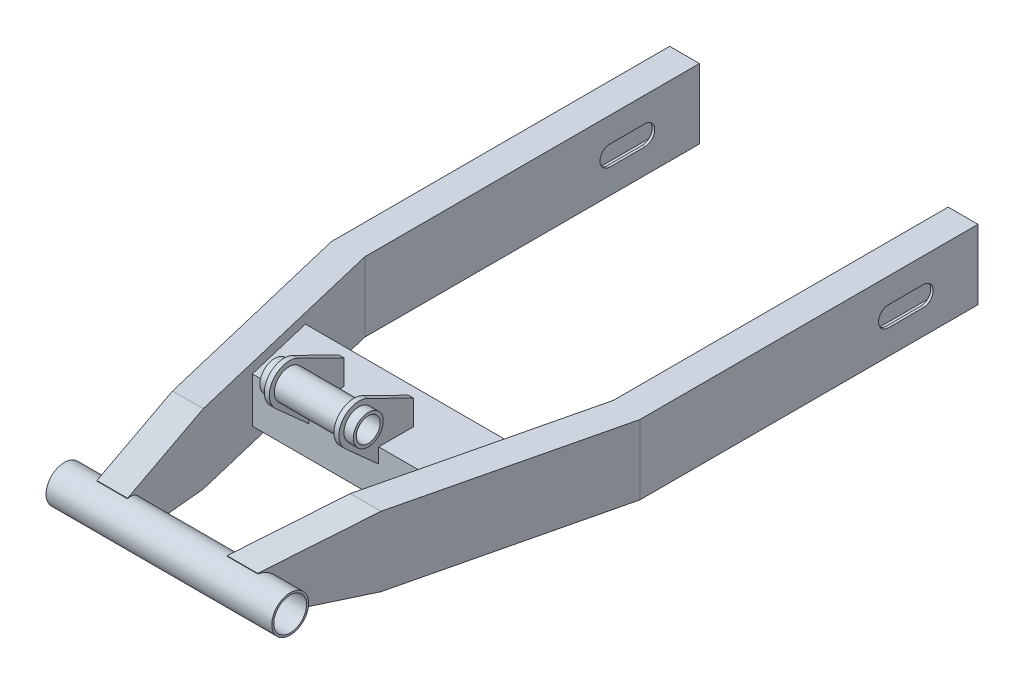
ISO-10303-21;
HEADER;
FILE_DESCRIPTION(('STEP AP214'),'2;1');
FILE_NAME('part.step','',(''),(''),'','','');
FILE_SCHEMA(('AUTOMOTIVE_DESIGN { 1 0 10303 214 1 1 1 1 }'));
ENDSEC;
DATA;
#1=APPLICATION_CONTEXT('core data for automotive mechanical design processes');
#2=APPLICATION_PROTOCOL_DEFINITION('international standard','automotive_design',2000,#1);
#3=PRODUCT_CONTEXT('',#1,'mechanical');
#4=PRODUCT('Part','Part','',(#3));
#5=PRODUCT_RELATED_PRODUCT_CATEGORY('part','',(#4));
#6=PRODUCT_DEFINITION_FORMATION('','',#4);
#7=PRODUCT_DEFINITION_CONTEXT('part definition',#1,'design');
#8=PRODUCT_DEFINITION('design','',#6,#7);
#9=PRODUCT_DEFINITION_SHAPE('','',#8);
#10=(LENGTH_UNIT() NAMED_UNIT(*) SI_UNIT(.MILLI.,.METRE.));
#11=(NAMED_UNIT(*) PLANE_ANGLE_UNIT() SI_UNIT($,.RADIAN.));
#12=(NAMED_UNIT(*) SI_UNIT($,.STERADIAN.) SOLID_ANGLE_UNIT());
#13=UNCERTAINTY_MEASURE_WITH_UNIT(LENGTH_MEASURE(1.E-05),#10,'distance_accuracy_value','');
#14=(GEOMETRIC_REPRESENTATION_CONTEXT(3) GLOBAL_UNCERTAINTY_ASSIGNED_CONTEXT((#13)) GLOBAL_UNIT_ASSIGNED_CONTEXT((#10,
#11,#12)) REPRESENTATION_CONTEXT('',''));
#15=CARTESIAN_POINT('',(0.,0.,0.));
#16=DIRECTION('',(0.,0.,1.));
#17=DIRECTION('',(1.,0.,0.));
#18=AXIS2_PLACEMENT_3D('',#15,#16,#17);
#19=CARTESIAN_POINT('',(47.,54.7722557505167,-145.));
#20=DIRECTION('',(-1.,0.,0.));
#21=DIRECTION('',(0.,0.,1.));
#22=AXIS2_PLACEMENT_3D('',#19,#20,#21);
#23=CYLINDRICAL_SURFACE('',#22,15.);
#24=CARTESIAN_POINT('',(-47.,54.7722557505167,-145.));
#25=DIRECTION('',(1.,0.,0.));
#26=DIRECTION('',(0.,0.,-1.));
#27=AXIS2_PLACEMENT_3D('',#24,#25,#26);
#28=CIRCLE('',#27,15.);
#29=CARTESIAN_POINT('',(-47.,54.7722557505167,-160.));
#30=VERTEX_POINT('',#29);
#31=EDGE_CURVE('E672',#30,#30,#28,.T.);
#32=ORIENTED_EDGE('',*,*,#31,.T.);
#33=EDGE_LOOP('',(#32));
#34=FACE_BOUND('',#33,.T.);
#35=CARTESIAN_POINT('',(-37.5,54.7722557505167,-145.));
#36=DIRECTION('',(1.,0.,0.));
#37=DIRECTION('',(0.,0.,-1.));
#38=AXIS2_PLACEMENT_3D('',#35,#36,#37);
#39=CIRCLE('',#38,15.);
#40=CARTESIAN_POINT('',(-37.5,54.7722557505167,-160.));
#41=VERTEX_POINT('',#40);
#42=EDGE_CURVE('E659',#41,#41,#39,.T.);
#43=ORIENTED_EDGE('',*,*,#42,.F.);
#44=EDGE_LOOP('',(#43));
#45=FACE_BOUND('',#44,.T.);
#46=ADVANCED_FACE('F37',(#34,#45),#23,.T.);
#47=CARTESIAN_POINT('',(37.5,54.7722557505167,-145.));
#48=DIRECTION('',(1.,0.,0.));
#49=DIRECTION('',(0.,0.,-1.));
#50=AXIS2_PLACEMENT_3D('',#47,#48,#49);
#51=PLANE('',#50);
#52=CARTESIAN_POINT('',(37.5,54.7722557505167,-145.));
#53=DIRECTION('',(1.,0.,0.));
#54=DIRECTION('',(0.,0.,-1.));
#55=AXIS2_PLACEMENT_3D('',#52,#53,#54);
#56=CIRCLE('',#55,20.);
#57=CARTESIAN_POINT('',(37.5,72.7175733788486,-153.829811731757));
#58=VERTEX_POINT('',#57);
#59=CARTESIAN_POINT('',(37.5,39.876440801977,-131.65403817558));
#60=VERTEX_POINT('',#59);
#61=EDGE_CURVE('E697',#58,#60,#56,.T.);
#62=ORIENTED_EDGE('',*,*,#61,.T.);
#63=DIRECTION('',(0.,-0.667298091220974,-0.744790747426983));
#64=VECTOR('',#63,1.);
#65=CARTESIAN_POINT('',(37.5,9.99999999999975,-165.));
#66=LINE('',#65,#64);
#67=CARTESIAN_POINT('',(37.5,9.99999999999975,-165.));
#68=VERTEX_POINT('',#67);
#69=EDGE_CURVE('E700',#60,#68,#66,.T.);
#70=ORIENTED_EDGE('',*,*,#69,.T.);
#71=DIRECTION('',(0.,1.,0.));
#72=VECTOR('',#71,1.);
#73=CARTESIAN_POINT('',(37.5,24.9999999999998,-165.));
#74=LINE('',#73,#72);
#75=CARTESIAN_POINT('',(37.5,24.9999999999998,-165.));
#76=VERTEX_POINT('',#75);
#77=EDGE_CURVE('E702',#68,#76,#74,.T.);
#78=ORIENTED_EDGE('',*,*,#77,.T.);
#79=DIRECTION('',(0.,0.,-1.));
#80=VECTOR('',#79,1.);
#81=CARTESIAN_POINT('',(37.5,24.9999999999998,-165.));
#82=LINE('',#81,#80);
#83=CARTESIAN_POINT('',(37.5,24.9999999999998,-200.));
#84=VERTEX_POINT('',#83);
#85=EDGE_CURVE('E704',#76,#84,#82,.T.);
#86=ORIENTED_EDGE('',*,*,#85,.T.);
#87=DIRECTION('',(0.,1.,0.));
#88=VECTOR('',#87,1.);
#89=CARTESIAN_POINT('',(37.5,24.9999999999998,-200.));
#90=LINE('',#89,#88);
#91=CARTESIAN_POINT('',(37.5,50.,-200.));
#92=VERTEX_POINT('',#91);
#93=EDGE_CURVE('E706',#84,#92,#90,.T.);
#94=ORIENTED_EDGE('',*,*,#93,.T.);
#95=DIRECTION('',(0.,0.441490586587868,0.897265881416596));
#96=VECTOR('',#95,1.);
#97=CARTESIAN_POINT('',(37.5,50.,-200.));
#98=LINE('',#97,#96);
#99=EDGE_CURVE('E708',#92,#58,#98,.T.);
#100=ORIENTED_EDGE('',*,*,#99,.T.);
#101=EDGE_LOOP('',(#62,#70,#78,#86,#94,#100));
#102=FACE_BOUND('',#101,.T.);
#103=CARTESIAN_POINT('',(37.5,54.7722557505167,-145.));
#104=DIRECTION('',(1.,0.,0.));
#105=DIRECTION('',(0.,0.,-1.));
#106=AXIS2_PLACEMENT_3D('',#103,#104,#105);
#107=CIRCLE('',#106,15.);
#108=CARTESIAN_POINT('',(37.5,54.7722557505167,-160.));
#109=VERTEX_POINT('',#108);
#110=EDGE_CURVE('E678',#109,#109,#107,.F.);
#111=ORIENTED_EDGE('',*,*,#110,.T.);
#112=EDGE_LOOP('',(#111));
#113=FACE_BOUND('',#112,.T.);
#114=ADVANCED_FACE('F1281',(#102,#113),#51,.T.);
#115=CARTESIAN_POINT('',(32.5,54.7722557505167,-145.));
#116=DIRECTION('',(1.,0.,0.));
#117=DIRECTION('',(0.,0.,-1.));
#118=AXIS2_PLACEMENT_3D('',#115,#116,#117);
#119=PLANE('',#118);
#120=CARTESIAN_POINT('',(32.5,54.7722557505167,-145.));
#121=DIRECTION('',(1.,0.,0.));
#122=DIRECTION('',(0.,0.,-1.));
#123=AXIS2_PLACEMENT_3D('',#120,#121,#122);
#124=CIRCLE('',#123,20.);
#125=CARTESIAN_POINT('',(32.5,72.7175733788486,-153.829811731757));
#126=VERTEX_POINT('',#125);
#127=CARTESIAN_POINT('',(32.5,39.876440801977,-131.65403817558));
#128=VERTEX_POINT('',#127);
#129=EDGE_CURVE('E681',#126,#128,#124,.T.);
#130=ORIENTED_EDGE('',*,*,#129,.F.);
#131=DIRECTION('',(0.,0.441490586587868,0.897265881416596));
#132=VECTOR('',#131,1.);
#133=CARTESIAN_POINT('',(32.5,50.,-200.));
#134=LINE('',#133,#132);
#135=CARTESIAN_POINT('',(32.5,50.,-200.));
#136=VERTEX_POINT('',#135);
#137=EDGE_CURVE('E695',#136,#126,#134,.T.);
#138=ORIENTED_EDGE('',*,*,#137,.F.);
#139=DIRECTION('',(0.,1.,0.));
#140=VECTOR('',#139,1.);
#141=CARTESIAN_POINT('',(32.5,24.9999999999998,-200.));
#142=LINE('',#141,#140);
#143=CARTESIAN_POINT('',(32.5,24.9999999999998,-200.));
#144=VERTEX_POINT('',#143);
#145=EDGE_CURVE('E693',#144,#136,#142,.T.);
#146=ORIENTED_EDGE('',*,*,#145,.F.);
#147=DIRECTION('',(0.,0.,-1.));
#148=VECTOR('',#147,1.);
#149=CARTESIAN_POINT('',(32.5,24.9999999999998,-165.));
#150=LINE('',#149,#148);
#151=CARTESIAN_POINT('',(32.5,24.9999999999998,-165.));
#152=VERTEX_POINT('',#151);
#153=EDGE_CURVE('E690',#152,#144,#150,.T.);
#154=ORIENTED_EDGE('',*,*,#153,.F.);
#155=DIRECTION('',(0.,1.,0.));
#156=VECTOR('',#155,1.);
#157=CARTESIAN_POINT('',(32.5,24.9999999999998,-165.));
#158=LINE('',#157,#156);
#159=CARTESIAN_POINT('',(32.5,9.99999999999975,-165.));
#160=VERTEX_POINT('',#159);
#161=EDGE_CURVE('E687',#160,#152,#158,.T.);
#162=ORIENTED_EDGE('',*,*,#161,.F.);
#163=DIRECTION('',(0.,-0.667298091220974,-0.744790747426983));
#164=VECTOR('',#163,1.);
#165=CARTESIAN_POINT('',(32.5,9.99999999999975,-165.));
#166=LINE('',#165,#164);
#167=EDGE_CURVE('E684',#128,#160,#166,.T.);
#168=ORIENTED_EDGE('',*,*,#167,.F.);
#169=EDGE_LOOP('',(#130,#138,#146,#154,#162,#168));
#170=FACE_BOUND('',#169,.T.);
#171=CARTESIAN_POINT('',(32.5,54.7722557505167,-145.));
#172=DIRECTION('',(1.,0.,0.));
#173=DIRECTION('',(0.,0.,-1.));
#174=AXIS2_PLACEMENT_3D('',#171,#172,#173);
#175=CIRCLE('',#174,15.);
#176=CARTESIAN_POINT('',(32.5,54.7722557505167,-160.));
#177=VERTEX_POINT('',#176);
#178=EDGE_CURVE('E663',#177,#177,#175,.F.);
#179=ORIENTED_EDGE('',*,*,#178,.F.);
#180=EDGE_LOOP('',(#179));
#181=FACE_BOUND('',#180,.T.);
#182=ADVANCED_FACE('F1289',(#170,#181),#119,.F.);
#183=CARTESIAN_POINT('',(-155.,35.,-650.));
#184=DIRECTION('',(0.,0.,1.));
#185=DIRECTION('',(1.,0.,0.));
#186=AXIS2_PLACEMENT_3D('',#183,#184,#185);
#187=PLANE('',#186);
#188=DIRECTION('',(-1.,0.,0.));
#189=VECTOR('',#188,1.);
#190=CARTESIAN_POINT('',(-155.,-35.,-650.));
#191=LINE('',#190,#189);
#192=CARTESIAN_POINT('',(-125.,-35.,-650.));
#193=VERTEX_POINT('',#192);
#194=CARTESIAN_POINT('',(-155.,-35.,-650.));
#195=VERTEX_POINT('',#194);
#196=EDGE_CURVE('E1013',#193,#195,#191,.T.);
#197=ORIENTED_EDGE('',*,*,#196,.T.);
#198=DIRECTION('',(0.,-1.,0.));
#199=VECTOR('',#198,1.);
#200=CARTESIAN_POINT('',(-155.,35.,-650.));
#201=LINE('',#200,#199);
#202=CARTESIAN_POINT('',(-155.,35.,-650.));
#203=VERTEX_POINT('',#202);
#204=EDGE_CURVE('E1027',#203,#195,#201,.T.);
#205=ORIENTED_EDGE('',*,*,#204,.F.);
#206=DIRECTION('',(-1.,0.,0.));
#207=VECTOR('',#206,1.);
#208=CARTESIAN_POINT('',(-155.,35.,-650.));
#209=LINE('',#208,#207);
#210=CARTESIAN_POINT('',(-125.,35.,-650.));
#211=VERTEX_POINT('',#210);
#212=EDGE_CURVE('E1025',#211,#203,#209,.T.);
#213=ORIENTED_EDGE('',*,*,#212,.F.);
#214=DIRECTION('',(0.,-1.,0.));
#215=VECTOR('',#214,1.);
#216=CARTESIAN_POINT('',(-125.,35.,-650.));
#217=LINE('',#216,#215);
#218=EDGE_CURVE('E1030',#211,#193,#217,.T.);
#219=ORIENTED_EDGE('',*,*,#218,.T.);
#220=EDGE_LOOP('',(#197,#205,#213,#219));
#221=FACE_BOUND('',#220,.T.);
#222=DIRECTION('',(-1.,0.,0.));
#223=VECTOR('',#222,1.);
#224=CARTESIAN_POINT('',(-155.,-32.5,-650.));
#225=LINE('',#224,#223);
#226=CARTESIAN_POINT('',(-127.5,-32.5,-650.));
#227=VERTEX_POINT('',#226);
#228=CARTESIAN_POINT('',(-152.5,-32.5,-650.));
#229=VERTEX_POINT('',#228);
#230=EDGE_CURVE('E859',#227,#229,#225,.T.);
#231=ORIENTED_EDGE('',*,*,#230,.F.);
#232=DIRECTION('',(0.,-1.,0.));
#233=VECTOR('',#232,1.);
#234=CARTESIAN_POINT('',(-127.5,35.,-650.));
#235=LINE('',#234,#233);
#236=CARTESIAN_POINT('',(-127.5,32.5,-650.));
#237=VERTEX_POINT('',#236);
#238=EDGE_CURVE('E845',#237,#227,#235,.T.);
#239=ORIENTED_EDGE('',*,*,#238,.F.);
#240=DIRECTION('',(-1.,0.,0.));
#241=VECTOR('',#240,1.);
#242=CARTESIAN_POINT('',(-155.,32.5,-650.));
#243=LINE('',#242,#241);
#244=CARTESIAN_POINT('',(-152.5,32.5,-650.));
#245=VERTEX_POINT('',#244);
#246=EDGE_CURVE('E856',#237,#245,#243,.T.);
#247=ORIENTED_EDGE('',*,*,#246,.T.);
#248=DIRECTION('',(0.,-1.,0.));
#249=VECTOR('',#248,1.);
#250=CARTESIAN_POINT('',(-152.5,35.,-650.));
#251=LINE('',#250,#249);
#252=EDGE_CURVE('E905',#245,#229,#251,.T.);
#253=ORIENTED_EDGE('',*,*,#252,.T.);
#254=EDGE_LOOP('',(#231,#239,#247,#253));
#255=FACE_BOUND('',#254,.T.);
#256=ADVANCED_FACE('F1170',(#221,#255),#187,.F.);
#257=CARTESIAN_POINT('',(155.,35.,-650.));
#258=DIRECTION('',(0.,0.,1.));
#259=DIRECTION('',(1.,0.,0.));
#260=AXIS2_PLACEMENT_3D('',#257,#258,#259);
#261=PLANE('',#260);
#262=DIRECTION('',(-1.,0.,0.));
#263=VECTOR('',#262,1.);
#264=CARTESIAN_POINT('',(155.,-35.,-650.));
#265=LINE('',#264,#263);
#266=CARTESIAN_POINT('',(155.,-35.,-650.));
#267=VERTEX_POINT('',#266);
#268=CARTESIAN_POINT('',(125.,-35.,-650.));
#269=VERTEX_POINT('',#268);
#270=EDGE_CURVE('E947',#267,#269,#265,.T.);
#271=ORIENTED_EDGE('',*,*,#270,.T.);
#272=DIRECTION('',(0.,-1.,0.));
#273=VECTOR('',#272,1.);
#274=CARTESIAN_POINT('',(125.,35.,-650.));
#275=LINE('',#274,#273);
#276=CARTESIAN_POINT('',(125.,35.,-650.));
#277=VERTEX_POINT('',#276);
#278=EDGE_CURVE('E976',#277,#269,#275,.T.);
#279=ORIENTED_EDGE('',*,*,#278,.F.);
#280=DIRECTION('',(-1.,0.,0.));
#281=VECTOR('',#280,1.);
#282=CARTESIAN_POINT('',(155.,35.,-650.));
#283=LINE('',#282,#281);
#284=CARTESIAN_POINT('',(155.,35.,-650.));
#285=VERTEX_POINT('',#284);
#286=EDGE_CURVE('E960',#285,#277,#283,.T.);
#287=ORIENTED_EDGE('',*,*,#286,.F.);
#288=DIRECTION('',(0.,-1.,0.));
#289=VECTOR('',#288,1.);
#290=CARTESIAN_POINT('',(155.,35.,-650.));
#291=LINE('',#290,#289);
#292=EDGE_CURVE('E979',#285,#267,#291,.T.);
#293=ORIENTED_EDGE('',*,*,#292,.T.);
#294=EDGE_LOOP('',(#271,#279,#287,#293));
#295=FACE_BOUND('',#294,.T.);
#296=DIRECTION('',(-1.,0.,0.));
#297=VECTOR('',#296,1.);
#298=CARTESIAN_POINT('',(80.8463493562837,-32.5,-650.));
#299=LINE('',#298,#297);
#300=CARTESIAN_POINT('',(152.5,-32.5,-650.));
#301=VERTEX_POINT('',#300);
#302=CARTESIAN_POINT('',(127.5,-32.5,-650.));
#303=VERTEX_POINT('',#302);
#304=EDGE_CURVE('E900',#301,#303,#299,.T.);
#305=ORIENTED_EDGE('',*,*,#304,.F.);
#306=DIRECTION('',(0.,-1.,0.));
#307=VECTOR('',#306,1.);
#308=CARTESIAN_POINT('',(152.5,35.,-650.));
#309=LINE('',#308,#307);
#310=CARTESIAN_POINT('',(152.5,32.5,-650.));
#311=VERTEX_POINT('',#310);
#312=EDGE_CURVE('E871',#311,#301,#309,.T.);
#313=ORIENTED_EDGE('',*,*,#312,.F.);
#314=DIRECTION('',(-1.,0.,0.));
#315=VECTOR('',#314,1.);
#316=CARTESIAN_POINT('',(80.8463493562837,32.5,-650.));
#317=LINE('',#316,#315);
#318=CARTESIAN_POINT('',(127.5,32.5,-650.));
#319=VERTEX_POINT('',#318);
#320=EDGE_CURVE('E897',#311,#319,#317,.T.);
#321=ORIENTED_EDGE('',*,*,#320,.T.);
#322=DIRECTION('',(0.,-1.,0.));
#323=VECTOR('',#322,1.);
#324=CARTESIAN_POINT('',(127.5,35.,-650.));
#325=LINE('',#324,#323);
#326=EDGE_CURVE('E892',#319,#303,#325,.T.);
#327=ORIENTED_EDGE('',*,*,#326,.T.);
#328=EDGE_LOOP('',(#305,#313,#321,#327));
#329=FACE_BOUND('',#328,.T.);
#330=ADVANCED_FACE('F1263',(#295,#329),#261,.F.);
#331=CARTESIAN_POINT('',(-113.5,0.,0.));
#332=DIRECTION('',(1.,0.,0.));
#333=DIRECTION('',(0.,0.,-1.));
#334=AXIS2_PLACEMENT_3D('',#331,#332,#333);
#335=PLANE('',#334);
#336=CARTESIAN_POINT('',(-113.5,0.,0.));
#337=DIRECTION('',(-1.,0.,0.));
#338=DIRECTION('',(0.,0.,1.));
#339=AXIS2_PLACEMENT_3D('',#336,#337,#338);
#340=CIRCLE('',#339,18.5);
#341=CARTESIAN_POINT('',(-113.5,0.,18.5));
#342=VERTEX_POINT('',#341);
#343=EDGE_CURVE('E988',#342,#342,#340,.T.);
#344=ORIENTED_EDGE('',*,*,#343,.T.);
#345=EDGE_LOOP('',(#344));
#346=FACE_BOUND('',#345,.T.);
#347=CARTESIAN_POINT('',(-113.5,0.,0.));
#348=DIRECTION('',(-1.,0.,0.));
#349=DIRECTION('',(0.,0.,1.));
#350=AXIS2_PLACEMENT_3D('',#347,#348,#349);
#351=CIRCLE('',#350,16.5);
#352=CARTESIAN_POINT('',(-113.5,0.,16.5));
#353=VERTEX_POINT('',#352);
#354=EDGE_CURVE('E940',#353,#353,#351,.T.);
#355=ORIENTED_EDGE('',*,*,#354,.F.);
#356=EDGE_LOOP('',(#355));
#357=FACE_BOUND('',#356,.T.);
#358=ADVANCED_FACE('F1880',(#346,#357),#335,.F.);
#359=CARTESIAN_POINT('',(113.5,0.,0.));
#360=DIRECTION('',(-1.,0.,0.));
#361=DIRECTION('',(0.,0.,1.));
#362=AXIS2_PLACEMENT_3D('',#359,#360,#361);
#363=PLANE('',#362);
#364=CARTESIAN_POINT('',(113.5,0.,0.));
#365=DIRECTION('',(-1.,0.,0.));
#366=DIRECTION('',(0.,0.,1.));
#367=AXIS2_PLACEMENT_3D('',#364,#365,#366);
#368=CIRCLE('',#367,18.5);
#369=CARTESIAN_POINT('',(113.5,0.,18.5));
#370=VERTEX_POINT('',#369);
#371=EDGE_CURVE('E985',#370,#370,#368,.T.);
#372=ORIENTED_EDGE('',*,*,#371,.F.);
#373=EDGE_LOOP('',(#372));
#374=FACE_BOUND('',#373,.T.);
#375=CARTESIAN_POINT('',(113.5,0.,0.));
#376=DIRECTION('',(-1.,0.,0.));
#377=DIRECTION('',(0.,0.,1.));
#378=AXIS2_PLACEMENT_3D('',#375,#376,#377);
#379=CIRCLE('',#378,16.5);
#380=CARTESIAN_POINT('',(113.5,0.,16.5));
#381=VERTEX_POINT('',#380);
#382=EDGE_CURVE('E937',#381,#381,#379,.T.);
#383=ORIENTED_EDGE('',*,*,#382,.T.);
#384=EDGE_LOOP('',(#383));
#385=FACE_BOUND('',#384,.T.);
#386=ADVANCED_FACE('F1903',(#374,#385),#363,.F.);
#387=CARTESIAN_POINT('',(-241.610738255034,0.,0.));
#388=DIRECTION('',(-1.,0.,0.));
#389=DIRECTION('',(0.,0.,1.));
#390=AXIS2_PLACEMENT_3D('',#387,#388,#389);
#391=CYLINDRICAL_SURFACE('',#390,18.5);
#392=DIRECTION('',(-1.,0.,0.));
#393=VECTOR('',#392,1.);
#394=CARTESIAN_POINT('',(-241.610738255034,18.5,0.));
#395=LINE('',#394,#393);
#396=CARTESIAN_POINT('',(-50.,18.5,0.));
#397=VERTEX_POINT('',#396);
#398=CARTESIAN_POINT('',(-80.8463493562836,18.5,0.));
#399=VERTEX_POINT('',#398);
#400=EDGE_CURVE('E991',#397,#399,#395,.T.);
#401=ORIENTED_EDGE('',*,*,#400,.T.);
#402=CARTESIAN_POINT('',(-80.8463493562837,0.,0.));
#403=DIRECTION('',(0.972562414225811,0.,-0.232642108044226));
#404=DIRECTION('',(-0.232642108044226,0.,-0.972562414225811));
#405=AXIS2_PLACEMENT_3D('',#402,#403,#404);
#406=ELLIPSE('',#405,19.0219154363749,18.5);
#407=CARTESIAN_POINT('',(-80.8463493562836,-18.5,0.));
#408=VERTEX_POINT('',#407);
#409=EDGE_CURVE('E997',#399,#408,#406,.F.);
#410=ORIENTED_EDGE('',*,*,#409,.T.);
#411=DIRECTION('',(-1.,0.,0.));
#412=VECTOR('',#411,1.);
#413=CARTESIAN_POINT('',(-241.610738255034,-18.5,0.));
#414=LINE('',#413,#412);
#415=CARTESIAN_POINT('',(-50.,-18.5,0.));
#416=VERTEX_POINT('',#415);
#417=EDGE_CURVE('E994',#408,#416,#414,.F.);
#418=ORIENTED_EDGE('',*,*,#417,.T.);
#419=CARTESIAN_POINT('',(-50.,0.,0.));
#420=DIRECTION('',(-0.972562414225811,0.,0.232642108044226));
#421=DIRECTION('',(-0.232642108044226,0.,-0.972562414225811));
#422=AXIS2_PLACEMENT_3D('',#419,#420,#421);
#423=ELLIPSE('',#422,19.0219154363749,18.5);
#424=EDGE_CURVE('E1045',#416,#397,#423,.F.);
#425=ORIENTED_EDGE('',*,*,#424,.T.);
#426=EDGE_LOOP('',(#401,#410,#418,#425));
#427=FACE_BOUND('',#426,.T.);
#428=ORIENTED_EDGE('',*,*,#343,.F.);
#429=EDGE_LOOP('',(#428));
#430=FACE_BOUND('',#429,.T.);
#431=ORIENTED_EDGE('',*,*,#371,.T.);
#432=EDGE_LOOP('',(#431));
#433=FACE_BOUND('',#432,.T.);
#434=DIRECTION('',(-1.,0.,0.));
#435=VECTOR('',#434,1.);
#436=CARTESIAN_POINT('',(-241.610738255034,-18.5,0.));
#437=LINE('',#436,#435);
#438=CARTESIAN_POINT('',(80.8463493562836,-18.5,0.));
#439=VERTEX_POINT('',#438);
#440=CARTESIAN_POINT('',(50.,-18.5,0.));
#441=VERTEX_POINT('',#440);
#442=EDGE_CURVE('E1057',#439,#441,#437,.T.);
#443=ORIENTED_EDGE('',*,*,#442,.F.);
#444=CARTESIAN_POINT('',(80.8463493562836,0.,0.));
#445=DIRECTION('',(-0.972562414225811,0.,-0.232642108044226));
#446=DIRECTION('',(-0.232642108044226,0.,0.972562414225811));
#447=AXIS2_PLACEMENT_3D('',#444,#445,#446);
#448=ELLIPSE('',#447,19.0219154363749,18.5);
#449=CARTESIAN_POINT('',(80.8463493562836,18.5,0.));
#450=VERTEX_POINT('',#449);
#451=EDGE_CURVE('E1054',#450,#439,#448,.T.);
#452=ORIENTED_EDGE('',*,*,#451,.F.);
#453=DIRECTION('',(-1.,0.,0.));
#454=VECTOR('',#453,1.);
#455=CARTESIAN_POINT('',(-241.610738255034,18.5,0.));
#456=LINE('',#455,#454);
#457=CARTESIAN_POINT('',(50.,18.5,0.));
#458=VERTEX_POINT('',#457);
#459=EDGE_CURVE('E1048',#458,#450,#456,.F.);
#460=ORIENTED_EDGE('',*,*,#459,.F.);
#461=CARTESIAN_POINT('',(50.,0.,0.));
#462=DIRECTION('',(0.972562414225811,0.,0.232642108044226));
#463=DIRECTION('',(-0.232642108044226,0.,0.972562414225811));
#464=AXIS2_PLACEMENT_3D('',#461,#462,#463);
#465=ELLIPSE('',#464,19.0219154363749,18.5);
#466=EDGE_CURVE('E1051',#441,#458,#465,.T.);
#467=ORIENTED_EDGE('',*,*,#466,.F.);
#468=EDGE_LOOP('',(#443,#452,#460,#467));
#469=FACE_BOUND('',#468,.T.);
#470=ADVANCED_FACE('F1242',(#427,#430,#433,#469),#391,.T.);
#471=CARTESIAN_POINT('',(-155.,35.,-310.));
#472=DIRECTION('',(0.972562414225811,0.,-0.232642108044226));
#473=DIRECTION('',(-0.232642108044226,0.,-0.972562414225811));
#474=AXIS2_PLACEMENT_3D('',#471,#472,#473);
#475=PLANE('',#474);
#476=DIRECTION('',(0.232642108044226,0.,0.972562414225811));
#477=VECTOR('',#476,1.);
#478=CARTESIAN_POINT('',(-155.,-35.,-310.));
#479=LINE('',#478,#477);
#480=CARTESIAN_POINT('',(-155.,-35.,-310.));
#481=VERTEX_POINT('',#480);
#482=CARTESIAN_POINT('',(-104.766881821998,-34.9999999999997,-99.9999999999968));
#483=VERTEX_POINT('',#482);
#484=EDGE_CURVE('E1003',#481,#483,#479,.T.);
#485=ORIENTED_EDGE('',*,*,#484,.T.);
#486=DIRECTION('',(-0.229875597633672,-0.153759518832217,-0.960996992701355));
#487=VECTOR('',#486,1.);
#488=CARTESIAN_POINT('',(-80.8463493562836,-19.,0.));
#489=LINE('',#488,#487);
#490=CARTESIAN_POINT('',(-80.8463493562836,-19.,0.));
#491=VERTEX_POINT('',#490);
#492=EDGE_CURVE('E1095',#483,#491,#489,.F.);
#493=ORIENTED_EDGE('',*,*,#492,.T.);
#494=DIRECTION('',(0.,-1.,0.));
#495=VECTOR('',#494,1.);
#496=CARTESIAN_POINT('',(-80.8463493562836,35.,0.));
#497=LINE('',#496,#495);
#498=EDGE_CURVE('E1039',#408,#491,#497,.T.);
#499=ORIENTED_EDGE('',*,*,#498,.F.);
#500=ORIENTED_EDGE('',*,*,#409,.F.);
#501=CARTESIAN_POINT('',(-80.8463493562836,19.,0.));
#502=VERTEX_POINT('',#501);
#503=EDGE_CURVE('E1040',#502,#399,#497,.T.);
#504=ORIENTED_EDGE('',*,*,#503,.F.);
#505=DIRECTION('',(-0.229875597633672,0.153759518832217,-0.960996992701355));
#506=VECTOR('',#505,1.);
#507=CARTESIAN_POINT('',(-107.421339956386,36.7755177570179,-111.096985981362));
#508=LINE('',#507,#506);
#509=CARTESIAN_POINT('',(-104.766881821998,34.9999999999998,-99.999999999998));
#510=VERTEX_POINT('',#509);
#511=EDGE_CURVE('E1076',#502,#510,#508,.T.);
#512=ORIENTED_EDGE('',*,*,#511,.T.);
#513=DIRECTION('',(0.232642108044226,0.,0.972562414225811));
#514=VECTOR('',#513,1.);
#515=CARTESIAN_POINT('',(-155.,35.,-310.));
#516=LINE('',#515,#514);
#517=CARTESIAN_POINT('',(-155.,35.,-310.));
#518=VERTEX_POINT('',#517);
#519=EDGE_CURVE('E1018',#518,#510,#516,.T.);
#520=ORIENTED_EDGE('',*,*,#519,.F.);
#521=DIRECTION('',(0.,-1.,0.));
#522=VECTOR('',#521,1.);
#523=CARTESIAN_POINT('',(-155.,35.,-310.));
#524=LINE('',#523,#522);
#525=EDGE_CURVE('E1042',#518,#481,#524,.T.);
#526=ORIENTED_EDGE('',*,*,#525,.T.);
#527=EDGE_LOOP('',(#485,#493,#499,#500,#504,#512,#520,#526));
#528=FACE_BOUND('',#527,.T.);
#529=ADVANCED_FACE('F1960',(#528),#475,.F.);
#530=CARTESIAN_POINT('',(-80.8463493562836,35.,0.));
#531=DIRECTION('',(0.,0.,-1.));
#532=DIRECTION('',(-1.,0.,0.));
#533=AXIS2_PLACEMENT_3D('',#530,#531,#532);
#534=PLANE('',#533);
#535=ORIENTED_EDGE('',*,*,#498,.T.);
#536=DIRECTION('',(1.,0.,0.));
#537=VECTOR('',#536,1.);
#538=CARTESIAN_POINT('',(-80.8463493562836,-19.,0.));
#539=LINE('',#538,#537);
#540=CARTESIAN_POINT('',(-50.,-19.,0.));
#541=VERTEX_POINT('',#540);
#542=EDGE_CURVE('E1088',#491,#541,#539,.T.);
#543=ORIENTED_EDGE('',*,*,#542,.T.);
#544=DIRECTION('',(0.,-1.,0.));
#545=VECTOR('',#544,1.);
#546=CARTESIAN_POINT('',(-50.,35.,0.));
#547=LINE('',#546,#545);
#548=EDGE_CURVE('E1036',#416,#541,#547,.T.);
#549=ORIENTED_EDGE('',*,*,#548,.F.);
#550=ORIENTED_EDGE('',*,*,#417,.F.);
#551=EDGE_LOOP('',(#535,#543,#549,#550));
#552=FACE_BOUND('',#551,.T.);
#553=ADVANCED_FACE('F1955',(#552),#534,.F.);
#554=CARTESIAN_POINT('',(-50.,19.,0.));
#555=VERTEX_POINT('',#554);
#556=EDGE_CURVE('E1037',#555,#397,#547,.T.);
#557=ORIENTED_EDGE('',*,*,#556,.F.);
#558=DIRECTION('',(-1.,0.,0.));
#559=VECTOR('',#558,1.);
#560=CARTESIAN_POINT('',(-80.8463493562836,19.,0.));
#561=LINE('',#560,#559);
#562=EDGE_CURVE('E1074',#555,#502,#561,.T.);
#563=ORIENTED_EDGE('',*,*,#562,.T.);
#564=ORIENTED_EDGE('',*,*,#503,.T.);
#565=ORIENTED_EDGE('',*,*,#400,.F.);
#566=EDGE_LOOP('',(#557,#563,#564,#565));
#567=FACE_BOUND('',#566,.T.);
#568=ADVANCED_FACE('F1721',(#567),#534,.F.);
#569=CARTESIAN_POINT('',(-125.,35.,-313.538171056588));
#570=DIRECTION('',(-0.972562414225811,0.,0.232642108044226));
#571=DIRECTION('',(0.232642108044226,0.,0.972562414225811));
#572=AXIS2_PLACEMENT_3D('',#569,#570,#571);
#573=PLANE('',#572);
#574=DIRECTION('',(0.232642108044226,0.,0.972562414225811));
#575=VECTOR('',#574,1.);
#576=CARTESIAN_POINT('',(-95.0001231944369,24.9999999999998,-188.123417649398));
#577=LINE('',#576,#575);
#578=CARTESIAN_POINT('',(-106.21325129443,24.9999999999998,-235.));
#579=VERTEX_POINT('',#578);
#580=CARTESIAN_POINT('',(-89.4688785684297,24.9999999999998,-165.));
#581=VERTEX_POINT('',#580);
#582=EDGE_CURVE('E775',#579,#581,#577,.T.);
#583=ORIENTED_EDGE('',*,*,#582,.F.);
#584=DIRECTION('',(0.,1.,0.));
#585=VECTOR('',#584,1.);
#586=CARTESIAN_POINT('',(-106.21325129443,24.9999999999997,-235.));
#587=LINE('',#586,#585);
#588=CARTESIAN_POINT('',(-106.21325129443,-35.,-235.));
#589=VERTEX_POINT('',#588);
#590=EDGE_CURVE('E783',#589,#579,#587,.T.);
#591=ORIENTED_EDGE('',*,*,#590,.F.);
#592=DIRECTION('',(-0.232642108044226,0.,-0.972562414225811));
#593=VECTOR('',#592,1.);
#594=CARTESIAN_POINT('',(-125.,-35.,-313.538171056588));
#595=LINE('',#594,#593);
#596=CARTESIAN_POINT('',(-125.,-35.,-313.538171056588));
#597=VERTEX_POINT('',#596);
#598=EDGE_CURVE('E1006',#589,#597,#595,.T.);
#599=ORIENTED_EDGE('',*,*,#598,.T.);
#600=DIRECTION('',(0.,-1.,0.));
#601=VECTOR('',#600,1.);
#602=CARTESIAN_POINT('',(-125.,35.,-313.538171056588));
#603=LINE('',#602,#601);
#604=CARTESIAN_POINT('',(-125.,35.,-313.538171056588));
#605=VERTEX_POINT('',#604);
#606=EDGE_CURVE('E1033',#605,#597,#603,.T.);
#607=ORIENTED_EDGE('',*,*,#606,.F.);
#608=DIRECTION('',(-0.232642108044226,0.,-0.972562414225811));
#609=VECTOR('',#608,1.);
#610=CARTESIAN_POINT('',(-125.,35.,-313.538171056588));
#611=LINE('',#610,#609);
#612=CARTESIAN_POINT('',(-73.9205324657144,34.9999999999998,-99.9999999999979));
#613=VERTEX_POINT('',#612);
#614=EDGE_CURVE('E1021',#613,#605,#611,.T.);
#615=ORIENTED_EDGE('',*,*,#614,.F.);
#616=DIRECTION('',(0.229875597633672,-0.153759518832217,0.960996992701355));
#617=VECTOR('',#616,1.);
#618=CARTESIAN_POINT('',(-78.2049977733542,37.8657992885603,-117.911245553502));
#619=LINE('',#618,#617);
#620=EDGE_CURVE('E1072',#613,#555,#619,.T.);
#621=ORIENTED_EDGE('',*,*,#620,.T.);
#622=ORIENTED_EDGE('',*,*,#556,.T.);
#623=ORIENTED_EDGE('',*,*,#424,.F.);
#624=ORIENTED_EDGE('',*,*,#548,.T.);
#625=DIRECTION('',(0.229875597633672,0.153759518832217,0.960996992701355));
#626=VECTOR('',#625,1.);
#627=CARTESIAN_POINT('',(-51.6300071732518,-20.0902815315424,-6.81425957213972));
#628=LINE('',#627,#626);
#629=CARTESIAN_POINT('',(-73.9205324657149,-35.,-99.9999999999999));
#630=VERTEX_POINT('',#629);
#631=EDGE_CURVE('E1091',#541,#630,#628,.F.);
#632=ORIENTED_EDGE('',*,*,#631,.T.);
#633=CARTESIAN_POINT('',(-92.9373557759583,-35.,-179.5));
#634=VERTEX_POINT('',#633);
#635=EDGE_CURVE('E1007',#630,#634,#595,.T.);
#636=ORIENTED_EDGE('',*,*,#635,.T.);
#637=DIRECTION('',(-0.166774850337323,-0.697203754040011,-0.697203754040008));
#638=VECTOR('',#637,1.);
#639=CARTESIAN_POINT('',(-92.3114234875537,-32.3832844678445,-176.883284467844));
#640=LINE('',#639,#638);
#641=CARTESIAN_POINT('',(-89.4688785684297,-20.5,-165.));
#642=VERTEX_POINT('',#641);
#643=EDGE_CURVE('E756',#642,#634,#640,.T.);
#644=ORIENTED_EDGE('',*,*,#643,.F.);
#645=DIRECTION('',(0.,-1.,0.));
#646=VECTOR('',#645,1.);
#647=CARTESIAN_POINT('',(-89.4688785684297,24.9999999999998,-165.));
#648=LINE('',#647,#646);
#649=EDGE_CURVE('E755',#581,#642,#648,.T.);
#650=ORIENTED_EDGE('',*,*,#649,.F.);
#651=EDGE_LOOP('',(#583,#591,#599,#607,#615,#621,#622,#623,#624,#632,#636,#644,#650));
#652=FACE_BOUND('',#651,.T.);
#653=ADVANCED_FACE('F1183',(#652),#573,.F.);
#654=CARTESIAN_POINT('',(-155.,35.,-650.));
#655=DIRECTION('',(1.,0.,0.));
#656=DIRECTION('',(0.,0.,-1.));
#657=AXIS2_PLACEMENT_3D('',#654,#655,#656);
#658=PLANE('',#657);
#659=DIRECTION('',(0.,0.,-1.));
#660=VECTOR('',#659,1.);
#661=CARTESIAN_POINT('',(-155.,-10.,-560.));
#662=LINE('',#661,#660);
#663=CARTESIAN_POINT('',(-155.,-10.,-560.));
#664=VERTEX_POINT('',#663);
#665=CARTESIAN_POINT('',(-155.,-10.,-595.));
#666=VERTEX_POINT('',#665);
#667=EDGE_CURVE('E551',#664,#666,#662,.T.);
#668=ORIENTED_EDGE('',*,*,#667,.T.);
#669=CARTESIAN_POINT('',(-155.,0.,-595.));
#670=DIRECTION('',(1.,0.,0.));
#671=DIRECTION('',(0.,0.,-1.));
#672=AXIS2_PLACEMENT_3D('',#669,#670,#671);
#673=CIRCLE('',#672,10.);
#674=CARTESIAN_POINT('',(-155.,9.99999999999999,-595.));
#675=VERTEX_POINT('',#674);
#676=EDGE_CURVE('E541',#666,#675,#673,.T.);
#677=ORIENTED_EDGE('',*,*,#676,.T.);
#678=DIRECTION('',(0.,0.,1.));
#679=VECTOR('',#678,1.);
#680=CARTESIAN_POINT('',(-155.,9.99999999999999,-595.));
#681=LINE('',#680,#679);
#682=CARTESIAN_POINT('',(-155.,9.99999999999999,-560.));
#683=VERTEX_POINT('',#682);
#684=EDGE_CURVE('E547',#675,#683,#681,.T.);
#685=ORIENTED_EDGE('',*,*,#684,.T.);
#686=CARTESIAN_POINT('',(-155.,0.,-560.));
#687=DIRECTION('',(1.,0.,0.));
#688=DIRECTION('',(0.,0.,-1.));
#689=AXIS2_PLACEMENT_3D('',#686,#687,#688);
#690=CIRCLE('',#689,10.);
#691=EDGE_CURVE('E53',#683,#664,#690,.T.);
#692=ORIENTED_EDGE('',*,*,#691,.T.);
#693=EDGE_LOOP('',(#668,#677,#685,#692));
#694=FACE_BOUND('',#693,.T.);
#695=DIRECTION('',(0.,0.,1.));
#696=VECTOR('',#695,1.);
#697=CARTESIAN_POINT('',(-155.,-35.,-650.));
#698=LINE('',#697,#696);
#699=EDGE_CURVE('E1000',#195,#481,#698,.T.);
#700=ORIENTED_EDGE('',*,*,#699,.T.);
#701=ORIENTED_EDGE('',*,*,#525,.F.);
#702=DIRECTION('',(0.,0.,1.));
#703=VECTOR('',#702,1.);
#704=CARTESIAN_POINT('',(-155.,35.,-650.));
#705=LINE('',#704,#703);
#706=EDGE_CURVE('E1015',#203,#518,#705,.T.);
#707=ORIENTED_EDGE('',*,*,#706,.F.);
#708=ORIENTED_EDGE('',*,*,#204,.T.);
#709=EDGE_LOOP('',(#700,#701,#707,#708));
#710=FACE_BOUND('',#709,.T.);
#711=ADVANCED_FACE('F39',(#694,#710),#658,.F.);
#712=CARTESIAN_POINT('',(-125.,35.,-650.));
#713=DIRECTION('',(-1.,0.,0.));
#714=DIRECTION('',(0.,0.,1.));
#715=AXIS2_PLACEMENT_3D('',#712,#713,#714);
#716=PLANE('',#715);
#717=DIRECTION('',(0.,0.,-1.));
#718=VECTOR('',#717,1.);
#719=CARTESIAN_POINT('',(-125.,10.,-650.));
#720=LINE('',#719,#718);
#721=CARTESIAN_POINT('',(-125.,9.99999999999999,-560.));
#722=VERTEX_POINT('',#721);
#723=CARTESIAN_POINT('',(-125.,9.99999999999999,-595.));
#724=VERTEX_POINT('',#723);
#725=EDGE_CURVE('E575',#722,#724,#720,.T.);
#726=ORIENTED_EDGE('',*,*,#725,.T.);
#727=CARTESIAN_POINT('',(-125.,0.,-595.));
#728=DIRECTION('',(-1.,0.,0.));
#729=DIRECTION('',(0.,0.,1.));
#730=AXIS2_PLACEMENT_3D('',#727,#728,#729);
#731=CIRCLE('',#730,10.);
#732=CARTESIAN_POINT('',(-125.,-10.,-595.));
#733=VERTEX_POINT('',#732);
#734=EDGE_CURVE('E612',#724,#733,#731,.T.);
#735=ORIENTED_EDGE('',*,*,#734,.T.);
#736=DIRECTION('',(0.,0.,1.));
#737=VECTOR('',#736,1.);
#738=CARTESIAN_POINT('',(-125.,-10.,-650.));
#739=LINE('',#738,#737);
#740=CARTESIAN_POINT('',(-125.,-10.,-560.));
#741=VERTEX_POINT('',#740);
#742=EDGE_CURVE('E598',#733,#741,#739,.T.);
#743=ORIENTED_EDGE('',*,*,#742,.T.);
#744=CARTESIAN_POINT('',(-125.,0.,-560.));
#745=DIRECTION('',(-1.,0.,0.));
#746=DIRECTION('',(0.,0.,1.));
#747=AXIS2_PLACEMENT_3D('',#744,#745,#746);
#748=CIRCLE('',#747,10.);
#749=EDGE_CURVE('E586',#741,#722,#748,.T.);
#750=ORIENTED_EDGE('',*,*,#749,.T.);
#751=EDGE_LOOP('',(#726,#735,#743,#750));
#752=FACE_BOUND('',#751,.T.);
#753=DIRECTION('',(0.,0.,-1.));
#754=VECTOR('',#753,1.);
#755=CARTESIAN_POINT('',(-125.,-35.,-650.));
#756=LINE('',#755,#754);
#757=EDGE_CURVE('E1010',#597,#193,#756,.T.);
#758=ORIENTED_EDGE('',*,*,#757,.T.);
#759=ORIENTED_EDGE('',*,*,#218,.F.);
#760=DIRECTION('',(0.,0.,-1.));
#761=VECTOR('',#760,1.);
#762=CARTESIAN_POINT('',(-125.,35.,-650.));
#763=LINE('',#762,#761);
#764=EDGE_CURVE('E1023',#605,#211,#763,.T.);
#765=ORIENTED_EDGE('',*,*,#764,.F.);
#766=ORIENTED_EDGE('',*,*,#606,.T.);
#767=EDGE_LOOP('',(#758,#759,#765,#766));
#768=FACE_BOUND('',#767,.T.);
#769=ADVANCED_FACE('F1157',(#752,#768),#716,.F.);
#770=CARTESIAN_POINT('',(-155.,35.,0.));
#771=DIRECTION('',(0.,1.,0.));
#772=DIRECTION('',(0.,0.,1.));
#773=AXIS2_PLACEMENT_3D('',#770,#771,#772);
#774=PLANE('',#773);
#775=ORIENTED_EDGE('',*,*,#519,.T.);
#776=DIRECTION('',(1.,0.,0.));
#777=VECTOR('',#776,1.);
#778=CARTESIAN_POINT('',(-50.,35.,-100.));
#779=LINE('',#778,#777);
#780=EDGE_CURVE('E1069',#510,#613,#779,.T.);
#781=ORIENTED_EDGE('',*,*,#780,.T.);
#782=ORIENTED_EDGE('',*,*,#614,.T.);
#783=ORIENTED_EDGE('',*,*,#764,.T.);
#784=ORIENTED_EDGE('',*,*,#212,.T.);
#785=ORIENTED_EDGE('',*,*,#706,.T.);
#786=EDGE_LOOP('',(#775,#781,#782,#783,#784,#785));
#787=FACE_BOUND('',#786,.T.);
#788=ADVANCED_FACE('F1160',(#787),#774,.T.);
#789=CARTESIAN_POINT('',(-155.,-35.,0.));
#790=DIRECTION('',(0.,1.,0.));
#791=DIRECTION('',(0.,0.,1.));
#792=AXIS2_PLACEMENT_3D('',#789,#790,#791);
#793=PLANE('',#792);
#794=ORIENTED_EDGE('',*,*,#635,.F.);
#795=DIRECTION('',(-1.,0.,0.));
#796=VECTOR('',#795,1.);
#797=CARTESIAN_POINT('',(-155.,-35.,-100.));
#798=LINE('',#797,#796);
#799=EDGE_CURVE('E1093',#630,#483,#798,.T.);
#800=ORIENTED_EDGE('',*,*,#799,.T.);
#801=ORIENTED_EDGE('',*,*,#484,.F.);
#802=ORIENTED_EDGE('',*,*,#699,.F.);
#803=ORIENTED_EDGE('',*,*,#196,.F.);
#804=ORIENTED_EDGE('',*,*,#757,.F.);
#805=ORIENTED_EDGE('',*,*,#598,.F.);
#806=EDGE_CURVE('E1011',#634,#589,#595,.T.);
#807=ORIENTED_EDGE('',*,*,#806,.F.);
#808=EDGE_LOOP('',(#794,#800,#801,#802,#803,#804,#805,#807));
#809=FACE_BOUND('',#808,.T.);
#810=ADVANCED_FACE('F1175',(#809),#793,.F.);
#811=CARTESIAN_POINT('',(155.,35.,-310.));
#812=DIRECTION('',(-0.972562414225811,0.,-0.232642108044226));
#813=DIRECTION('',(-0.232642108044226,0.,0.972562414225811));
#814=AXIS2_PLACEMENT_3D('',#811,#812,#813);
#815=PLANE('',#814);
#816=DIRECTION('',(0.,-1.,0.));
#817=VECTOR('',#816,1.);
#818=CARTESIAN_POINT('',(80.8463493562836,35.,0.));
#819=LINE('',#818,#817);
#820=CARTESIAN_POINT('',(80.8463493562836,-19.,0.));
#821=VERTEX_POINT('',#820);
#822=EDGE_CURVE('E967',#439,#821,#819,.T.);
#823=ORIENTED_EDGE('',*,*,#822,.T.);
#824=DIRECTION('',(0.229875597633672,-0.153759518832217,-0.960996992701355));
#825=VECTOR('',#824,1.);
#826=CARTESIAN_POINT('',(80.8463493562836,-19.,0.));
#827=LINE('',#826,#825);
#828=CARTESIAN_POINT('',(104.766881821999,-35.,-100.));
#829=VERTEX_POINT('',#828);
#830=EDGE_CURVE('E1081',#821,#829,#827,.T.);
#831=ORIENTED_EDGE('',*,*,#830,.T.);
#832=DIRECTION('',(0.232642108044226,0.,-0.972562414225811));
#833=VECTOR('',#832,1.);
#834=CARTESIAN_POINT('',(155.,-35.,-310.));
#835=LINE('',#834,#833);
#836=CARTESIAN_POINT('',(155.,-35.,-310.));
#837=VERTEX_POINT('',#836);
#838=EDGE_CURVE('E943',#829,#837,#835,.T.);
#839=ORIENTED_EDGE('',*,*,#838,.T.);
#840=DIRECTION('',(0.,-1.,0.));
#841=VECTOR('',#840,1.);
#842=CARTESIAN_POINT('',(155.,35.,-310.));
#843=LINE('',#842,#841);
#844=CARTESIAN_POINT('',(155.,35.,-310.));
#845=VERTEX_POINT('',#844);
#846=EDGE_CURVE('E982',#845,#837,#843,.T.);
#847=ORIENTED_EDGE('',*,*,#846,.F.);
#848=DIRECTION('',(0.232642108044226,0.,-0.972562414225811));
#849=VECTOR('',#848,1.);
#850=CARTESIAN_POINT('',(155.,35.,-310.));
#851=LINE('',#850,#849);
#852=CARTESIAN_POINT('',(104.766881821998,34.9999999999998,-99.9999999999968));
#853=VERTEX_POINT('',#852);
#854=EDGE_CURVE('E955',#853,#845,#851,.T.);
#855=ORIENTED_EDGE('',*,*,#854,.F.);
#856=DIRECTION('',(0.229875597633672,0.153759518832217,-0.960996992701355));
#857=VECTOR('',#856,1.);
#858=CARTESIAN_POINT('',(103.502854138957,34.154515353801,-94.7157209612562));
#859=LINE('',#858,#857);
#860=CARTESIAN_POINT('',(80.8463493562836,19.,0.));
#861=VERTEX_POINT('',#860);
#862=EDGE_CURVE('E1063',#853,#861,#859,.F.);
#863=ORIENTED_EDGE('',*,*,#862,.T.);
#864=EDGE_CURVE('E968',#861,#450,#819,.T.);
#865=ORIENTED_EDGE('',*,*,#864,.T.);
#866=ORIENTED_EDGE('',*,*,#451,.T.);
#867=EDGE_LOOP('',(#823,#831,#839,#847,#855,#863,#865,#866));
#868=FACE_BOUND('',#867,.T.);
#869=ADVANCED_FACE('F1237',(#868),#815,.F.);
#870=CARTESIAN_POINT('',(125.,35.,-313.538171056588));
#871=DIRECTION('',(0.972562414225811,0.,0.232642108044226));
#872=DIRECTION('',(0.232642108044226,0.,-0.972562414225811));
#873=AXIS2_PLACEMENT_3D('',#870,#871,#872);
#874=PLANE('',#873);
#875=DIRECTION('',(-0.232642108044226,0.,0.972562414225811));
#876=VECTOR('',#875,1.);
#877=CARTESIAN_POINT('',(125.,-35.,-313.538171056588));
#878=LINE('',#877,#876);
#879=CARTESIAN_POINT('',(125.,-35.,-313.538171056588));
#880=VERTEX_POINT('',#879);
#881=CARTESIAN_POINT('',(106.21325129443,-35.,-235.));
#882=VERTEX_POINT('',#881);
#883=EDGE_CURVE('E952',#880,#882,#878,.T.);
#884=ORIENTED_EDGE('',*,*,#883,.T.);
#885=DIRECTION('',(0.,1.,0.));
#886=VECTOR('',#885,1.);
#887=CARTESIAN_POINT('',(106.21325129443,24.9999999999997,-235.));
#888=LINE('',#887,#886);
#889=CARTESIAN_POINT('',(106.21325129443,24.9999999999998,-235.));
#890=VERTEX_POINT('',#889);
#891=EDGE_CURVE('E739',#882,#890,#888,.T.);
#892=ORIENTED_EDGE('',*,*,#891,.T.);
#893=DIRECTION('',(-0.232642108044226,0.,0.972562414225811));
#894=VECTOR('',#893,1.);
#895=CARTESIAN_POINT('',(95.0001231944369,24.9999999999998,-188.123417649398));
#896=LINE('',#895,#894);
#897=CARTESIAN_POINT('',(89.4688785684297,24.9999999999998,-165.));
#898=VERTEX_POINT('',#897);
#899=EDGE_CURVE('E736',#890,#898,#896,.T.);
#900=ORIENTED_EDGE('',*,*,#899,.T.);
#901=DIRECTION('',(0.,-1.,0.));
#902=VECTOR('',#901,1.);
#903=CARTESIAN_POINT('',(89.4688785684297,24.9999999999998,-165.));
#904=LINE('',#903,#902);
#905=CARTESIAN_POINT('',(89.4688785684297,-20.5,-165.));
#906=VERTEX_POINT('',#905);
#907=EDGE_CURVE('E750',#898,#906,#904,.T.);
#908=ORIENTED_EDGE('',*,*,#907,.T.);
#909=DIRECTION('',(0.166774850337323,-0.697203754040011,-0.697203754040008));
#910=VECTOR('',#909,1.);
#911=CARTESIAN_POINT('',(92.3114234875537,-32.3832844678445,-176.883284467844));
#912=LINE('',#911,#910);
#913=CARTESIAN_POINT('',(92.9373557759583,-35.,-179.5));
#914=VERTEX_POINT('',#913);
#915=EDGE_CURVE('E747',#906,#914,#912,.T.);
#916=ORIENTED_EDGE('',*,*,#915,.T.);
#917=CARTESIAN_POINT('',(73.9205324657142,-34.9999999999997,-99.9999999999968));
#918=VERTEX_POINT('',#917);
#919=EDGE_CURVE('E951',#914,#918,#878,.T.);
#920=ORIENTED_EDGE('',*,*,#919,.T.);
#921=DIRECTION('',(-0.229875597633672,0.153759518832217,0.960996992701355));
#922=VECTOR('',#921,1.);
#923=CARTESIAN_POINT('',(51.6300071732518,-20.0902815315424,-6.81425957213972));
#924=LINE('',#923,#922);
#925=CARTESIAN_POINT('',(50.,-19.,0.));
#926=VERTEX_POINT('',#925);
#927=EDGE_CURVE('E1086',#918,#926,#924,.T.);
#928=ORIENTED_EDGE('',*,*,#927,.T.);
#929=DIRECTION('',(0.,-1.,0.));
#930=VECTOR('',#929,1.);
#931=CARTESIAN_POINT('',(50.,35.,0.));
#932=LINE('',#931,#930);
#933=EDGE_CURVE('E970',#441,#926,#932,.T.);
#934=ORIENTED_EDGE('',*,*,#933,.F.);
#935=ORIENTED_EDGE('',*,*,#466,.T.);
#936=CARTESIAN_POINT('',(50.,19.,0.));
#937=VERTEX_POINT('',#936);
#938=EDGE_CURVE('E971',#937,#458,#932,.T.);
#939=ORIENTED_EDGE('',*,*,#938,.F.);
#940=DIRECTION('',(-0.229875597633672,-0.153759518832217,0.960996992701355));
#941=VECTOR('',#940,1.);
#942=CARTESIAN_POINT('',(74.2865119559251,35.2447968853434,-101.529980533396));
#943=LINE('',#942,#941);
#944=CARTESIAN_POINT('',(73.9205324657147,34.9999999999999,-99.999999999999));
#945=VERTEX_POINT('',#944);
#946=EDGE_CURVE('E1067',#937,#945,#943,.F.);
#947=ORIENTED_EDGE('',*,*,#946,.T.);
#948=DIRECTION('',(-0.232642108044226,0.,0.972562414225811));
#949=VECTOR('',#948,1.);
#950=CARTESIAN_POINT('',(125.,35.,-313.538171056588));
#951=LINE('',#950,#949);
#952=CARTESIAN_POINT('',(125.,35.,-313.538171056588));
#953=VERTEX_POINT('',#952);
#954=EDGE_CURVE('E964',#953,#945,#951,.T.);
#955=ORIENTED_EDGE('',*,*,#954,.F.);
#956=DIRECTION('',(0.,-1.,0.));
#957=VECTOR('',#956,1.);
#958=CARTESIAN_POINT('',(125.,35.,-313.538171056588));
#959=LINE('',#958,#957);
#960=EDGE_CURVE('E973',#953,#880,#959,.T.);
#961=ORIENTED_EDGE('',*,*,#960,.T.);
#962=EDGE_LOOP('',(#884,#892,#900,#908,#916,#920,#928,#934,#935,#939,#947,#955,#961));
#963=FACE_BOUND('',#962,.T.);
#964=ADVANCED_FACE('F1221',(#963),#874,.F.);
#965=CARTESIAN_POINT('',(80.8463493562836,35.,0.));
#966=DIRECTION('',(0.,0.,-1.));
#967=DIRECTION('',(-1.,0.,0.));
#968=AXIS2_PLACEMENT_3D('',#965,#966,#967);
#969=PLANE('',#968);
#970=ORIENTED_EDGE('',*,*,#933,.T.);
#971=DIRECTION('',(1.,0.,0.));
#972=VECTOR('',#971,1.);
#973=CARTESIAN_POINT('',(80.8463493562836,-19.,0.));
#974=LINE('',#973,#972);
#975=EDGE_CURVE('E1078',#926,#821,#974,.T.);
#976=ORIENTED_EDGE('',*,*,#975,.T.);
#977=ORIENTED_EDGE('',*,*,#822,.F.);
#978=ORIENTED_EDGE('',*,*,#442,.T.);
#979=EDGE_LOOP('',(#970,#976,#977,#978));
#980=FACE_BOUND('',#979,.T.);
#981=ADVANCED_FACE('F1235',(#980),#969,.F.);
#982=ORIENTED_EDGE('',*,*,#864,.F.);
#983=DIRECTION('',(-1.,0.,0.));
#984=VECTOR('',#983,1.);
#985=CARTESIAN_POINT('',(80.8463493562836,19.,0.));
#986=LINE('',#985,#984);
#987=EDGE_CURVE('E1065',#861,#937,#986,.T.);
#988=ORIENTED_EDGE('',*,*,#987,.T.);
#989=ORIENTED_EDGE('',*,*,#938,.T.);
#990=ORIENTED_EDGE('',*,*,#459,.T.);
#991=EDGE_LOOP('',(#982,#988,#989,#990));
#992=FACE_BOUND('',#991,.T.);
#993=ADVANCED_FACE('F1244',(#992),#969,.F.);
#994=CARTESIAN_POINT('',(155.,35.,-650.));
#995=DIRECTION('',(-1.,0.,0.));
#996=DIRECTION('',(0.,0.,1.));
#997=AXIS2_PLACEMENT_3D('',#994,#995,#996);
#998=PLANE('',#997);
#999=DIRECTION('',(0.,0.,1.));
#1000=VECTOR('',#999,1.);
#1001=CARTESIAN_POINT('',(155.,9.99999999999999,-595.));
#1002=LINE('',#1001,#1000);
#1003=CARTESIAN_POINT('',(155.,9.99999999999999,-595.));
#1004=VERTEX_POINT('',#1003);
#1005=CARTESIAN_POINT('',(155.,9.99999999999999,-560.));
#1006=VERTEX_POINT('',#1005);
#1007=EDGE_CURVE('E528',#1004,#1006,#1002,.T.);
#1008=ORIENTED_EDGE('',*,*,#1007,.F.);
#1009=CARTESIAN_POINT('',(155.,0.,-595.));
#1010=DIRECTION('',(1.,0.,0.));
#1011=DIRECTION('',(0.,0.,-1.));
#1012=AXIS2_PLACEMENT_3D('',#1009,#1010,#1011);
#1013=CIRCLE('',#1012,10.);
#1014=CARTESIAN_POINT('',(155.,-10.,-595.));
#1015=VERTEX_POINT('',#1014);
#1016=EDGE_CURVE('E534',#1015,#1004,#1013,.T.);
#1017=ORIENTED_EDGE('',*,*,#1016,.F.);
#1018=DIRECTION('',(0.,0.,-1.));
#1019=VECTOR('',#1018,1.);
#1020=CARTESIAN_POINT('',(155.,-10.,-560.));
#1021=LINE('',#1020,#1019);
#1022=CARTESIAN_POINT('',(155.,-10.,-560.));
#1023=VERTEX_POINT('',#1022);
#1024=EDGE_CURVE('E539',#1023,#1015,#1021,.T.);
#1025=ORIENTED_EDGE('',*,*,#1024,.F.);
#1026=CARTESIAN_POINT('',(155.,0.,-560.));
#1027=DIRECTION('',(1.,0.,0.));
#1028=DIRECTION('',(0.,0.,-1.));
#1029=AXIS2_PLACEMENT_3D('',#1026,#1027,#1028);
#1030=CIRCLE('',#1029,10.);
#1031=EDGE_CURVE('E516',#1006,#1023,#1030,.T.);
#1032=ORIENTED_EDGE('',*,*,#1031,.F.);
#1033=EDGE_LOOP('',(#1008,#1017,#1025,#1032));
#1034=FACE_BOUND('',#1033,.T.);
#1035=DIRECTION('',(0.,0.,-1.));
#1036=VECTOR('',#1035,1.);
#1037=CARTESIAN_POINT('',(155.,-35.,-650.));
#1038=LINE('',#1037,#1036);
#1039=EDGE_CURVE('E945',#837,#267,#1038,.T.);
#1040=ORIENTED_EDGE('',*,*,#1039,.T.);
#1041=ORIENTED_EDGE('',*,*,#292,.F.);
#1042=DIRECTION('',(0.,0.,-1.));
#1043=VECTOR('',#1042,1.);
#1044=CARTESIAN_POINT('',(155.,35.,-650.));
#1045=LINE('',#1044,#1043);
#1046=EDGE_CURVE('E958',#845,#285,#1045,.T.);
#1047=ORIENTED_EDGE('',*,*,#1046,.F.);
#1048=ORIENTED_EDGE('',*,*,#846,.T.);
#1049=EDGE_LOOP('',(#1040,#1041,#1047,#1048));
#1050=FACE_BOUND('',#1049,.T.);
#1051=ADVANCED_FACE('F536',(#1034,#1050),#998,.F.);
#1052=CARTESIAN_POINT('',(125.,35.,-650.));
#1053=DIRECTION('',(1.,0.,0.));
#1054=DIRECTION('',(0.,0.,-1.));
#1055=AXIS2_PLACEMENT_3D('',#1052,#1053,#1054);
#1056=PLANE('',#1055);
#1057=DIRECTION('',(0.,0.,-1.));
#1058=VECTOR('',#1057,1.);
#1059=CARTESIAN_POINT('',(125.,-10.,-650.));
#1060=LINE('',#1059,#1058);
#1061=CARTESIAN_POINT('',(125.,-10.,-560.));
#1062=VERTEX_POINT('',#1061);
#1063=CARTESIAN_POINT('',(125.,-10.,-595.));
#1064=VERTEX_POINT('',#1063);
#1065=EDGE_CURVE('E595',#1062,#1064,#1060,.T.);
#1066=ORIENTED_EDGE('',*,*,#1065,.T.);
#1067=CARTESIAN_POINT('',(125.,0.,-595.));
#1068=DIRECTION('',(1.,0.,0.));
#1069=DIRECTION('',(0.,0.,-1.));
#1070=AXIS2_PLACEMENT_3D('',#1067,#1068,#1069);
#1071=CIRCLE('',#1070,10.);
#1072=CARTESIAN_POINT('',(125.,9.99999999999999,-595.));
#1073=VERTEX_POINT('',#1072);
#1074=EDGE_CURVE('E609',#1064,#1073,#1071,.T.);
#1075=ORIENTED_EDGE('',*,*,#1074,.T.);
#1076=DIRECTION('',(0.,0.,1.));
#1077=VECTOR('',#1076,1.);
#1078=CARTESIAN_POINT('',(125.,10.,-650.));
#1079=LINE('',#1078,#1077);
#1080=CARTESIAN_POINT('',(125.,9.99999999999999,-560.));
#1081=VERTEX_POINT('',#1080);
#1082=EDGE_CURVE('E572',#1073,#1081,#1079,.T.);
#1083=ORIENTED_EDGE('',*,*,#1082,.T.);
#1084=CARTESIAN_POINT('',(125.,0.,-560.));
#1085=DIRECTION('',(1.,0.,0.));
#1086=DIRECTION('',(0.,0.,-1.));
#1087=AXIS2_PLACEMENT_3D('',#1084,#1085,#1086);
#1088=CIRCLE('',#1087,10.);
#1089=EDGE_CURVE('E583',#1081,#1062,#1088,.T.);
#1090=ORIENTED_EDGE('',*,*,#1089,.T.);
#1091=EDGE_LOOP('',(#1066,#1075,#1083,#1090));
#1092=FACE_BOUND('',#1091,.T.);
#1093=DIRECTION('',(0.,0.,1.));
#1094=VECTOR('',#1093,1.);
#1095=CARTESIAN_POINT('',(125.,-35.,-650.));
#1096=LINE('',#1095,#1094);
#1097=EDGE_CURVE('E949',#269,#880,#1096,.T.);
#1098=ORIENTED_EDGE('',*,*,#1097,.T.);
#1099=ORIENTED_EDGE('',*,*,#960,.F.);
#1100=DIRECTION('',(0.,0.,1.));
#1101=VECTOR('',#1100,1.);
#1102=CARTESIAN_POINT('',(125.,35.,-650.));
#1103=LINE('',#1102,#1101);
#1104=EDGE_CURVE('E962',#277,#953,#1103,.T.);
#1105=ORIENTED_EDGE('',*,*,#1104,.F.);
#1106=ORIENTED_EDGE('',*,*,#278,.T.);
#1107=EDGE_LOOP('',(#1098,#1099,#1105,#1106));
#1108=FACE_BOUND('',#1107,.T.);
#1109=ADVANCED_FACE('F1268',(#1092,#1108),#1056,.F.);
#1110=CARTESIAN_POINT('',(80.8463493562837,35.,0.));
#1111=DIRECTION('',(0.,-1.,0.));
#1112=DIRECTION('',(0.,0.,-1.));
#1113=AXIS2_PLACEMENT_3D('',#1110,#1111,#1112);
#1114=PLANE('',#1113);
#1115=ORIENTED_EDGE('',*,*,#954,.T.);
#1116=DIRECTION('',(1.,0.,0.));
#1117=VECTOR('',#1116,1.);
#1118=CARTESIAN_POINT('',(80.8463493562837,35.,-100.));
#1119=LINE('',#1118,#1117);
#1120=EDGE_CURVE('E1060',#945,#853,#1119,.T.);
#1121=ORIENTED_EDGE('',*,*,#1120,.T.);
#1122=ORIENTED_EDGE('',*,*,#854,.T.);
#1123=ORIENTED_EDGE('',*,*,#1046,.T.);
#1124=ORIENTED_EDGE('',*,*,#286,.T.);
#1125=ORIENTED_EDGE('',*,*,#1104,.T.);
#1126=EDGE_LOOP('',(#1115,#1121,#1122,#1123,#1124,#1125));
#1127=FACE_BOUND('',#1126,.T.);
#1128=ADVANCED_FACE('F1254',(#1127),#1114,.F.);
#1129=CARTESIAN_POINT('',(80.8463493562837,-35.,0.));
#1130=DIRECTION('',(0.,-1.,0.));
#1131=DIRECTION('',(0.,0.,-1.));
#1132=AXIS2_PLACEMENT_3D('',#1129,#1130,#1131);
#1133=PLANE('',#1132);
#1134=ORIENTED_EDGE('',*,*,#838,.F.);
#1135=DIRECTION('',(-1.,0.,0.));
#1136=VECTOR('',#1135,1.);
#1137=CARTESIAN_POINT('',(50.,-35.,-100.));
#1138=LINE('',#1137,#1136);
#1139=EDGE_CURVE('E1083',#829,#918,#1138,.T.);
#1140=ORIENTED_EDGE('',*,*,#1139,.T.);
#1141=ORIENTED_EDGE('',*,*,#919,.F.);
#1142=EDGE_CURVE('E956',#882,#914,#878,.T.);
#1143=ORIENTED_EDGE('',*,*,#1142,.F.);
#1144=ORIENTED_EDGE('',*,*,#883,.F.);
#1145=ORIENTED_EDGE('',*,*,#1097,.F.);
#1146=ORIENTED_EDGE('',*,*,#270,.F.);
#1147=ORIENTED_EDGE('',*,*,#1039,.F.);
#1148=EDGE_LOOP('',(#1134,#1140,#1141,#1143,#1144,#1145,#1146,#1147));
#1149=FACE_BOUND('',#1148,.T.);
#1150=ADVANCED_FACE('F1227',(#1149),#1133,.T.);
#1151=CARTESIAN_POINT('',(80.8463493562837,35.,-100.));
#1152=DIRECTION('',(0.,-0.987440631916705,-0.157990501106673));
#1153=DIRECTION('',(0.,0.157990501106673,-0.987440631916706));
#1154=AXIS2_PLACEMENT_3D('',#1151,#1152,#1153);
#1155=PLANE('',#1154);
#1156=ORIENTED_EDGE('',*,*,#946,.F.);
#1157=ORIENTED_EDGE('',*,*,#987,.F.);
#1158=ORIENTED_EDGE('',*,*,#862,.F.);
#1159=ORIENTED_EDGE('',*,*,#1120,.F.);
#1160=EDGE_LOOP('',(#1156,#1157,#1158,#1159));
#1161=FACE_BOUND('',#1160,.T.);
#1162=ADVANCED_FACE('F1251',(#1161),#1155,.F.);
#1163=CARTESIAN_POINT('',(-155.,35.,-100.));
#1164=DIRECTION('',(0.,0.987440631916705,0.157990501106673));
#1165=DIRECTION('',(0.,-0.157990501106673,0.987440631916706));
#1166=AXIS2_PLACEMENT_3D('',#1163,#1164,#1165);
#1167=PLANE('',#1166);
#1168=ORIENTED_EDGE('',*,*,#511,.F.);
#1169=ORIENTED_EDGE('',*,*,#562,.F.);
#1170=ORIENTED_EDGE('',*,*,#620,.F.);
#1171=ORIENTED_EDGE('',*,*,#780,.F.);
#1172=EDGE_LOOP('',(#1168,#1169,#1170,#1171));
#1173=FACE_BOUND('',#1172,.T.);
#1174=ADVANCED_FACE('F1933',(#1173),#1167,.T.);
#1175=CARTESIAN_POINT('',(80.8463493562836,-19.,0.));
#1176=DIRECTION('',(0.,-0.987440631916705,0.157990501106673));
#1177=DIRECTION('',(0.,-0.157990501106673,-0.987440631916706));
#1178=AXIS2_PLACEMENT_3D('',#1175,#1176,#1177);
#1179=PLANE('',#1178);
#1180=ORIENTED_EDGE('',*,*,#927,.F.);
#1181=ORIENTED_EDGE('',*,*,#1139,.F.);
#1182=ORIENTED_EDGE('',*,*,#830,.F.);
#1183=ORIENTED_EDGE('',*,*,#975,.F.);
#1184=EDGE_LOOP('',(#1180,#1181,#1182,#1183));
#1185=FACE_BOUND('',#1184,.T.);
#1186=ADVANCED_FACE('F1231',(#1185),#1179,.T.);
#1187=CARTESIAN_POINT('',(-80.8463493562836,-19.,0.));
#1188=DIRECTION('',(0.,0.987440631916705,-0.157990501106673));
#1189=DIRECTION('',(0.,0.157990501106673,0.987440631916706));
#1190=AXIS2_PLACEMENT_3D('',#1187,#1188,#1189);
#1191=PLANE('',#1190);
#1192=ORIENTED_EDGE('',*,*,#492,.F.);
#1193=ORIENTED_EDGE('',*,*,#799,.F.);
#1194=ORIENTED_EDGE('',*,*,#631,.F.);
#1195=ORIENTED_EDGE('',*,*,#542,.F.);
#1196=EDGE_LOOP('',(#1192,#1193,#1194,#1195));
#1197=FACE_BOUND('',#1196,.T.);
#1198=ADVANCED_FACE('F1895',(#1197),#1191,.F.);
#1199=CARTESIAN_POINT('',(-216.686448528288,0.,0.));
#1200=DIRECTION('',(-1.,0.,0.));
#1201=DIRECTION('',(0.,0.,1.));
#1202=AXIS2_PLACEMENT_3D('',#1199,#1200,#1201);
#1203=CYLINDRICAL_SURFACE('',#1202,16.5);
#1204=ORIENTED_EDGE('',*,*,#354,.T.);
#1205=EDGE_LOOP('',(#1204));
#1206=FACE_BOUND('',#1205,.T.);
#1207=ORIENTED_EDGE('',*,*,#382,.F.);
#1208=EDGE_LOOP('',(#1207));
#1209=FACE_BOUND('',#1208,.T.);
#1210=ADVANCED_FACE('F1869',(#1206,#1209),#1203,.F.);
#1211=CARTESIAN_POINT('',(80.8463493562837,-32.5,0.));
#1212=DIRECTION('',(0.,-1.,0.));
#1213=DIRECTION('',(0.,0.,-1.));
#1214=AXIS2_PLACEMENT_3D('',#1211,#1212,#1213);
#1215=PLANE('',#1214);
#1216=DIRECTION('',(0.232642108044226,0.,-0.972562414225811));
#1217=VECTOR('',#1216,1.);
#1218=CARTESIAN_POINT('',(78.4149433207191,-32.5,-0.581605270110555));
#1219=LINE('',#1218,#1217);
#1220=CARTESIAN_POINT('',(102.243891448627,-32.5,-100.198736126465));
#1221=VERTEX_POINT('',#1220);
#1222=CARTESIAN_POINT('',(152.5,-32.5,-310.294847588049));
#1223=VERTEX_POINT('',#1222);
#1224=EDGE_CURVE('E769',#1221,#1223,#1219,.T.);
#1225=ORIENTED_EDGE('',*,*,#1224,.T.);
#1226=DIRECTION('',(0.,0.,-1.));
#1227=VECTOR('',#1226,1.);
#1228=CARTESIAN_POINT('',(152.5,-32.5,0.));
#1229=LINE('',#1228,#1227);
#1230=EDGE_CURVE('E868',#1223,#301,#1229,.T.);
#1231=ORIENTED_EDGE('',*,*,#1230,.T.);
#1232=ORIENTED_EDGE('',*,*,#304,.T.);
#1233=DIRECTION('',(0.,0.,1.));
#1234=VECTOR('',#1233,1.);
#1235=CARTESIAN_POINT('',(127.5,-32.5,0.));
#1236=LINE('',#1235,#1234);
#1237=CARTESIAN_POINT('',(127.5,-32.5,-313.243323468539));
#1238=VERTEX_POINT('',#1237);
#1239=EDGE_CURVE('E881',#303,#1238,#1236,.T.);
#1240=ORIENTED_EDGE('',*,*,#1239,.T.);
#1241=DIRECTION('',(-0.232642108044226,0.,0.972562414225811));
#1242=VECTOR('',#1241,1.);
#1243=CARTESIAN_POINT('',(54.1008829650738,-32.5,-6.39765797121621));
#1244=LINE('',#1243,#1242);
#1245=CARTESIAN_POINT('',(76.5386003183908,-32.5,-100.198736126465));
#1246=VERTEX_POINT('',#1245);
#1247=EDGE_CURVE('E875',#1238,#1246,#1244,.T.);
#1248=ORIENTED_EDGE('',*,*,#1247,.T.);
#1249=DIRECTION('',(-1.,0.,0.));
#1250=VECTOR('',#1249,1.);
#1251=CARTESIAN_POINT('',(80.8463493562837,-32.5,-100.198736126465));
#1252=LINE('',#1251,#1250);
#1253=EDGE_CURVE('E866',#1221,#1246,#1252,.T.);
#1254=ORIENTED_EDGE('',*,*,#1253,.F.);
#1255=EDGE_LOOP('',(#1225,#1231,#1232,#1240,#1248,#1254));
#1256=FACE_BOUND('',#1255,.T.);
#1257=ADVANCED_FACE('F1858',(#1256),#1215,.F.);
#1258=CARTESIAN_POINT('',(80.8463493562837,32.5,0.));
#1259=DIRECTION('',(0.,-1.,0.));
#1260=DIRECTION('',(0.,0.,-1.));
#1261=AXIS2_PLACEMENT_3D('',#1258,#1259,#1260);
#1262=PLANE('',#1261);
#1263=DIRECTION('',(-0.232642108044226,0.,0.972562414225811));
#1264=VECTOR('',#1263,1.);
#1265=CARTESIAN_POINT('',(54.1008829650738,32.5,-6.39765797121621));
#1266=LINE('',#1265,#1264);
#1267=CARTESIAN_POINT('',(127.5,32.5,-313.243323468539));
#1268=VERTEX_POINT('',#1267);
#1269=CARTESIAN_POINT('',(76.5386003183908,32.5,-100.198736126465));
#1270=VERTEX_POINT('',#1269);
#1271=EDGE_CURVE('E885',#1268,#1270,#1266,.T.);
#1272=ORIENTED_EDGE('',*,*,#1271,.F.);
#1273=DIRECTION('',(0.,0.,1.));
#1274=VECTOR('',#1273,1.);
#1275=CARTESIAN_POINT('',(127.5,32.5,0.));
#1276=LINE('',#1275,#1274);
#1277=EDGE_CURVE('E889',#319,#1268,#1276,.T.);
#1278=ORIENTED_EDGE('',*,*,#1277,.F.);
#1279=ORIENTED_EDGE('',*,*,#320,.F.);
#1280=DIRECTION('',(0.,0.,-1.));
#1281=VECTOR('',#1280,1.);
#1282=CARTESIAN_POINT('',(152.5,32.5,0.));
#1283=LINE('',#1282,#1281);
#1284=CARTESIAN_POINT('',(152.5,32.5,-310.294847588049));
#1285=VERTEX_POINT('',#1284);
#1286=EDGE_CURVE('E874',#1285,#311,#1283,.T.);
#1287=ORIENTED_EDGE('',*,*,#1286,.F.);
#1288=DIRECTION('',(0.232642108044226,0.,-0.972562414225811));
#1289=VECTOR('',#1288,1.);
#1290=CARTESIAN_POINT('',(78.4149433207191,32.5,-0.581605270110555));
#1291=LINE('',#1290,#1289);
#1292=CARTESIAN_POINT('',(102.243891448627,32.5,-100.198736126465));
#1293=VERTEX_POINT('',#1292);
#1294=EDGE_CURVE('E872',#1293,#1285,#1291,.T.);
#1295=ORIENTED_EDGE('',*,*,#1294,.F.);
#1296=DIRECTION('',(-1.,0.,0.));
#1297=VECTOR('',#1296,1.);
#1298=CARTESIAN_POINT('',(80.8463493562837,32.5,-100.198736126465));
#1299=LINE('',#1298,#1297);
#1300=EDGE_CURVE('E836',#1270,#1293,#1299,.F.);
#1301=ORIENTED_EDGE('',*,*,#1300,.F.);
#1302=EDGE_LOOP('',(#1272,#1278,#1279,#1287,#1295,#1301));
#1303=FACE_BOUND('',#1302,.T.);
#1304=ADVANCED_FACE('F1853',(#1303),#1262,.T.);
#1305=CARTESIAN_POINT('',(127.5,35.,-650.));
#1306=DIRECTION('',(1.,0.,0.));
#1307=DIRECTION('',(0.,0.,-1.));
#1308=AXIS2_PLACEMENT_3D('',#1305,#1306,#1307);
#1309=PLANE('',#1308);
#1310=CARTESIAN_POINT('',(127.5,0.,-595.));
#1311=DIRECTION('',(1.,0.,0.));
#1312=DIRECTION('',(0.,0.,-1.));
#1313=AXIS2_PLACEMENT_3D('',#1310,#1311,#1312);
#1314=CIRCLE('',#1313,10.);
#1315=CARTESIAN_POINT('',(127.5,-10.,-595.));
#1316=VERTEX_POINT('',#1315);
#1317=CARTESIAN_POINT('',(127.5,9.99999999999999,-595.));
#1318=VERTEX_POINT('',#1317);
#1319=EDGE_CURVE('E606',#1316,#1318,#1314,.T.);
#1320=ORIENTED_EDGE('',*,*,#1319,.F.);
#1321=DIRECTION('',(0.,0.,-1.));
#1322=VECTOR('',#1321,1.);
#1323=CARTESIAN_POINT('',(127.5,-10.,-650.));
#1324=LINE('',#1323,#1322);
#1325=CARTESIAN_POINT('',(127.5,-10.,-560.));
#1326=VERTEX_POINT('',#1325);
#1327=EDGE_CURVE('E593',#1326,#1316,#1324,.T.);
#1328=ORIENTED_EDGE('',*,*,#1327,.F.);
#1329=CARTESIAN_POINT('',(127.5,0.,-560.));
#1330=DIRECTION('',(1.,0.,0.));
#1331=DIRECTION('',(0.,0.,-1.));
#1332=AXIS2_PLACEMENT_3D('',#1329,#1330,#1331);
#1333=CIRCLE('',#1332,10.);
#1334=CARTESIAN_POINT('',(127.5,9.99999999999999,-560.));
#1335=VERTEX_POINT('',#1334);
#1336=EDGE_CURVE('E581',#1335,#1326,#1333,.T.);
#1337=ORIENTED_EDGE('',*,*,#1336,.F.);
#1338=DIRECTION('',(0.,0.,1.));
#1339=VECTOR('',#1338,1.);
#1340=CARTESIAN_POINT('',(127.5,10.,-650.));
#1341=LINE('',#1340,#1339);
#1342=EDGE_CURVE('E570',#1318,#1335,#1341,.T.);
#1343=ORIENTED_EDGE('',*,*,#1342,.F.);
#1344=EDGE_LOOP('',(#1320,#1328,#1337,#1343));
#1345=FACE_BOUND('',#1344,.T.);
#1346=ORIENTED_EDGE('',*,*,#1239,.F.);
#1347=ORIENTED_EDGE('',*,*,#326,.F.);
#1348=ORIENTED_EDGE('',*,*,#1277,.T.);
#1349=DIRECTION('',(0.,-1.,0.));
#1350=VECTOR('',#1349,1.);
#1351=CARTESIAN_POINT('',(127.5,35.,-313.243323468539));
#1352=LINE('',#1351,#1350);
#1353=EDGE_CURVE('E888',#1268,#1238,#1352,.T.);
#1354=ORIENTED_EDGE('',*,*,#1353,.T.);
#1355=EDGE_LOOP('',(#1346,#1347,#1348,#1354));
#1356=FACE_BOUND('',#1355,.T.);
#1357=ADVANCED_FACE('F1137',(#1345,#1356),#1309,.T.);
#1358=CARTESIAN_POINT('',(152.5,35.,-650.));
#1359=DIRECTION('',(-1.,0.,0.));
#1360=DIRECTION('',(0.,0.,1.));
#1361=AXIS2_PLACEMENT_3D('',#1358,#1359,#1360);
#1362=PLANE('',#1361);
#1363=CARTESIAN_POINT('',(152.5,0.,-595.));
#1364=DIRECTION('',(-1.,0.,0.));
#1365=DIRECTION('',(0.,0.,1.));
#1366=AXIS2_PLACEMENT_3D('',#1363,#1364,#1365);
#1367=CIRCLE('',#1366,10.);
#1368=CARTESIAN_POINT('',(152.5,9.99999999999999,-595.));
#1369=VERTEX_POINT('',#1368);
#1370=CARTESIAN_POINT('',(152.5,-10.,-595.));
#1371=VERTEX_POINT('',#1370);
#1372=EDGE_CURVE('E604',#1369,#1371,#1367,.T.);
#1373=ORIENTED_EDGE('',*,*,#1372,.F.);
#1374=DIRECTION('',(0.,0.,-1.));
#1375=VECTOR('',#1374,1.);
#1376=CARTESIAN_POINT('',(152.5,10.,-650.));
#1377=LINE('',#1376,#1375);
#1378=CARTESIAN_POINT('',(152.5,9.99999999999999,-560.));
#1379=VERTEX_POINT('',#1378);
#1380=EDGE_CURVE('E568',#1379,#1369,#1377,.T.);
#1381=ORIENTED_EDGE('',*,*,#1380,.F.);
#1382=CARTESIAN_POINT('',(152.5,0.,-560.));
#1383=DIRECTION('',(-1.,0.,0.));
#1384=DIRECTION('',(0.,0.,1.));
#1385=AXIS2_PLACEMENT_3D('',#1382,#1383,#1384);
#1386=CIRCLE('',#1385,10.);
#1387=CARTESIAN_POINT('',(152.5,-10.,-560.));
#1388=VERTEX_POINT('',#1387);
#1389=EDGE_CURVE('E519',#1388,#1379,#1386,.T.);
#1390=ORIENTED_EDGE('',*,*,#1389,.F.);
#1391=DIRECTION('',(0.,0.,1.));
#1392=VECTOR('',#1391,1.);
#1393=CARTESIAN_POINT('',(152.5,-10.,-650.));
#1394=LINE('',#1393,#1392);
#1395=EDGE_CURVE('E591',#1371,#1388,#1394,.T.);
#1396=ORIENTED_EDGE('',*,*,#1395,.F.);
#1397=EDGE_LOOP('',(#1373,#1381,#1390,#1396));
#1398=FACE_BOUND('',#1397,.T.);
#1399=ORIENTED_EDGE('',*,*,#1230,.F.);
#1400=DIRECTION('',(0.,-1.,0.));
#1401=VECTOR('',#1400,1.);
#1402=CARTESIAN_POINT('',(152.5,35.,-310.294847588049));
#1403=LINE('',#1402,#1401);
#1404=EDGE_CURVE('E862',#1285,#1223,#1403,.T.);
#1405=ORIENTED_EDGE('',*,*,#1404,.F.);
#1406=ORIENTED_EDGE('',*,*,#1286,.T.);
#1407=ORIENTED_EDGE('',*,*,#312,.T.);
#1408=EDGE_LOOP('',(#1399,#1405,#1406,#1407));
#1409=FACE_BOUND('',#1408,.T.);
#1410=ADVANCED_FACE('F1152',(#1398,#1409),#1362,.T.);
#1411=CARTESIAN_POINT('',(152.568593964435,35.,-310.581605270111));
#1412=DIRECTION('',(-0.972562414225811,0.,-0.232642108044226));
#1413=DIRECTION('',(-0.232642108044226,0.,0.972562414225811));
#1414=AXIS2_PLACEMENT_3D('',#1411,#1412,#1413);
#1415=PLANE('',#1414);
#1416=DIRECTION('',(0.229875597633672,0.153759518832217,-0.960996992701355));
#1417=VECTOR('',#1416,1.);
#1418=CARTESIAN_POINT('',(101.157646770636,31.7734311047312,-95.6576805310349));
#1419=LINE('',#1418,#1417);
#1420=CARTESIAN_POINT('',(79.982389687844,17.6096948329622,-7.13432883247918));
#1421=VERTEX_POINT('',#1420);
#1422=EDGE_CURVE('E876',#1293,#1421,#1419,.F.);
#1423=ORIENTED_EDGE('',*,*,#1422,.F.);
#1424=ORIENTED_EDGE('',*,*,#1294,.T.);
#1425=ORIENTED_EDGE('',*,*,#1404,.T.);
#1426=ORIENTED_EDGE('',*,*,#1224,.F.);
#1427=DIRECTION('',(0.229875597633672,-0.153759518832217,-0.960996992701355));
#1428=VECTOR('',#1427,1.);
#1429=CARTESIAN_POINT('',(78.5011419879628,-16.6189157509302,-0.94195956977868));
#1430=LINE('',#1429,#1428);
#1431=CARTESIAN_POINT('',(79.982389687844,-17.6096948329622,-7.13432883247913));
#1432=VERTEX_POINT('',#1431);
#1433=EDGE_CURVE('E826',#1432,#1221,#1430,.T.);
#1434=ORIENTED_EDGE('',*,*,#1433,.F.);
#1435=CARTESIAN_POINT('',(78.27582024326,0.,0.));
#1436=DIRECTION('',(-0.972562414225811,0.,-0.232642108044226));
#1437=DIRECTION('',(-0.232642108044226,0.,0.972562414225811));
#1438=AXIS2_PLACEMENT_3D('',#1435,#1436,#1437);
#1439=ELLIPSE('',#1438,19.5360212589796,19.);
#1440=EDGE_CURVE('E923',#1421,#1432,#1439,.T.);
#1441=ORIENTED_EDGE('',*,*,#1440,.F.);
#1442=EDGE_LOOP('',(#1423,#1424,#1425,#1426,#1434,#1441));
#1443=FACE_BOUND('',#1442,.T.);
#1444=ADVANCED_FACE('F1837',(#1443),#1415,.T.);
#1445=CARTESIAN_POINT('',(127.431406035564,35.,-312.956565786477));
#1446=DIRECTION('',(0.972562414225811,0.,0.232642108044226));
#1447=DIRECTION('',(0.232642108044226,0.,-0.972562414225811));
#1448=AXIS2_PLACEMENT_3D('',#1445,#1446,#1447);
#1449=PLANE('',#1448);
#1450=DIRECTION('',(-0.229875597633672,0.153759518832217,0.960996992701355));
#1451=VECTOR('',#1450,1.);
#1452=CARTESIAN_POINT('',(54.1541901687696,-17.5274836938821,-6.62050921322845));
#1453=LINE('',#1452,#1451);
#1454=CARTESIAN_POINT('',(54.2770985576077,-17.6096948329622,-7.13432883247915));
#1455=VERTEX_POINT('',#1454);
#1456=EDGE_CURVE('E840',#1246,#1455,#1453,.T.);
#1457=ORIENTED_EDGE('',*,*,#1456,.F.);
#1458=ORIENTED_EDGE('',*,*,#1247,.F.);
#1459=ORIENTED_EDGE('',*,*,#1353,.F.);
#1460=ORIENTED_EDGE('',*,*,#1271,.T.);
#1461=DIRECTION('',(-0.229875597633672,-0.153759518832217,0.960996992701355));
#1462=VECTOR('',#1461,1.);
#1463=CARTESIAN_POINT('',(76.8106949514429,32.6819990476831,-101.336230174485));
#1464=LINE('',#1463,#1462);
#1465=CARTESIAN_POINT('',(54.2770985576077,17.6096948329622,-7.13432883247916));
#1466=VERTEX_POINT('',#1465);
#1467=EDGE_CURVE('E853',#1466,#1270,#1464,.F.);
#1468=ORIENTED_EDGE('',*,*,#1467,.F.);
#1469=CARTESIAN_POINT('',(52.5705291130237,0.,0.));
#1470=DIRECTION('',(0.972562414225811,0.,0.232642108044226));
#1471=DIRECTION('',(-0.232642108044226,0.,0.972562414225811));
#1472=AXIS2_PLACEMENT_3D('',#1469,#1470,#1471);
#1473=ELLIPSE('',#1472,19.5360212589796,19.);
#1474=EDGE_CURVE('E926',#1455,#1466,#1473,.T.);
#1475=ORIENTED_EDGE('',*,*,#1474,.F.);
#1476=EDGE_LOOP('',(#1457,#1458,#1459,#1460,#1468,#1475));
#1477=FACE_BOUND('',#1476,.T.);
#1478=ADVANCED_FACE('F1827',(#1477),#1449,.T.);
#1479=CARTESIAN_POINT('',(80.8463493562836,-16.5313984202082,-0.394976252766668));
#1480=DIRECTION('',(0.,-0.987440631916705,0.157990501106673));
#1481=DIRECTION('',(0.,-0.157990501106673,-0.987440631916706));
#1482=AXIS2_PLACEMENT_3D('',#1479,#1480,#1481);
#1483=PLANE('',#1482);
#1484=ORIENTED_EDGE('',*,*,#1433,.T.);
#1485=ORIENTED_EDGE('',*,*,#1253,.T.);
#1486=ORIENTED_EDGE('',*,*,#1456,.T.);
#1487=DIRECTION('',(-1.,0.,0.));
#1488=VECTOR('',#1487,1.);
#1489=CARTESIAN_POINT('',(-216.686448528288,-17.6096948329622,-7.13432883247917));
#1490=LINE('',#1489,#1488);
#1491=EDGE_CURVE('E933',#1432,#1455,#1490,.T.);
#1492=ORIENTED_EDGE('',*,*,#1491,.F.);
#1493=EDGE_LOOP('',(#1484,#1485,#1486,#1492));
#1494=FACE_BOUND('',#1493,.T.);
#1495=ADVANCED_FACE('F1817',(#1494),#1483,.F.);
#1496=CARTESIAN_POINT('',(80.8463493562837,32.5313984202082,-100.394976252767));
#1497=DIRECTION('',(0.,-0.987440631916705,-0.157990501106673));
#1498=DIRECTION('',(0.,0.157990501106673,-0.987440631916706));
#1499=AXIS2_PLACEMENT_3D('',#1496,#1497,#1498);
#1500=PLANE('',#1499);
#1501=ORIENTED_EDGE('',*,*,#1467,.T.);
#1502=ORIENTED_EDGE('',*,*,#1300,.T.);
#1503=ORIENTED_EDGE('',*,*,#1422,.T.);
#1504=DIRECTION('',(-1.,0.,0.));
#1505=VECTOR('',#1504,1.);
#1506=CARTESIAN_POINT('',(-216.686448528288,17.6096948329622,-7.13432883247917));
#1507=LINE('',#1506,#1505);
#1508=EDGE_CURVE('E935',#1466,#1421,#1507,.F.);
#1509=ORIENTED_EDGE('',*,*,#1508,.F.);
#1510=EDGE_LOOP('',(#1501,#1502,#1503,#1509));
#1511=FACE_BOUND('',#1510,.T.);
#1512=ADVANCED_FACE('F1809',(#1511),#1500,.T.);
#1513=CARTESIAN_POINT('',(-216.686448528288,0.,0.));
#1514=DIRECTION('',(-1.,0.,0.));
#1515=DIRECTION('',(0.,0.,1.));
#1516=AXIS2_PLACEMENT_3D('',#1513,#1514,#1515);
#1517=CYLINDRICAL_SURFACE('',#1516,19.);
#1518=ORIENTED_EDGE('',*,*,#1508,.T.);
#1519=ORIENTED_EDGE('',*,*,#1440,.T.);
#1520=ORIENTED_EDGE('',*,*,#1491,.T.);
#1521=ORIENTED_EDGE('',*,*,#1474,.T.);
#1522=EDGE_LOOP('',(#1518,#1519,#1520,#1521));
#1523=FACE_BOUND('',#1522,.T.);
#1524=ADVANCED_FACE('F1734',(#1523),#1517,.T.);
#1525=CARTESIAN_POINT('',(-80.8463493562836,-16.5313984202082,-0.394976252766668));
#1526=DIRECTION('',(0.,0.987440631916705,-0.157990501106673));
#1527=DIRECTION('',(0.,0.157990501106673,0.987440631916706));
#1528=AXIS2_PLACEMENT_3D('',#1525,#1526,#1527);
#1529=PLANE('',#1528);
#1530=DIRECTION('',(-1.,0.,0.));
#1531=VECTOR('',#1530,1.);
#1532=CARTESIAN_POINT('',(-216.686448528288,-17.6096948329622,-7.13432883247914));
#1533=LINE('',#1532,#1531);
#1534=CARTESIAN_POINT('',(-79.982389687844,-17.6096948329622,-7.13432883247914));
#1535=VERTEX_POINT('',#1534);
#1536=CARTESIAN_POINT('',(-54.2770985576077,-17.6096948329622,-7.13432883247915));
#1537=VERTEX_POINT('',#1536);
#1538=EDGE_CURVE('E931',#1535,#1537,#1533,.F.);
#1539=ORIENTED_EDGE('',*,*,#1538,.T.);
#1540=DIRECTION('',(0.229875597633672,0.153759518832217,0.960996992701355));
#1541=VECTOR('',#1540,1.);
#1542=CARTESIAN_POINT('',(-54.1541901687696,-17.5274836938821,-6.62050921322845));
#1543=LINE('',#1542,#1541);
#1544=CARTESIAN_POINT('',(-76.5386003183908,-32.5,-100.198736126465));
#1545=VERTEX_POINT('',#1544);
#1546=EDGE_CURVE('E838',#1537,#1545,#1543,.F.);
#1547=ORIENTED_EDGE('',*,*,#1546,.T.);
#1548=DIRECTION('',(1.,0.,0.));
#1549=VECTOR('',#1548,1.);
#1550=CARTESIAN_POINT('',(-80.8463493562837,-32.5,-100.198736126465));
#1551=LINE('',#1550,#1549);
#1552=CARTESIAN_POINT('',(-102.243891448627,-32.5,-100.198736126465));
#1553=VERTEX_POINT('',#1552);
#1554=EDGE_CURVE('E823',#1545,#1553,#1551,.F.);
#1555=ORIENTED_EDGE('',*,*,#1554,.T.);
#1556=DIRECTION('',(-0.229875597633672,-0.153759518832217,-0.960996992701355));
#1557=VECTOR('',#1556,1.);
#1558=CARTESIAN_POINT('',(-78.5011419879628,-16.6189157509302,-0.94195956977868));
#1559=LINE('',#1558,#1557);
#1560=EDGE_CURVE('E819',#1553,#1535,#1559,.F.);
#1561=ORIENTED_EDGE('',*,*,#1560,.T.);
#1562=EDGE_LOOP('',(#1539,#1547,#1555,#1561));
#1563=FACE_BOUND('',#1562,.T.);
#1564=ADVANCED_FACE('F1790',(#1563),#1529,.T.);
#1565=CARTESIAN_POINT('',(-155.,32.5313984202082,-100.394976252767));
#1566=DIRECTION('',(0.,0.987440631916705,0.157990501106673));
#1567=DIRECTION('',(0.,-0.157990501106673,0.987440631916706));
#1568=AXIS2_PLACEMENT_3D('',#1565,#1566,#1567);
#1569=PLANE('',#1568);
#1570=DIRECTION('',(-1.,0.,0.));
#1571=VECTOR('',#1570,1.);
#1572=CARTESIAN_POINT('',(-216.686448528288,17.6096948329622,-7.13432883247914));
#1573=LINE('',#1572,#1571);
#1574=CARTESIAN_POINT('',(-54.2770985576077,17.6096948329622,-7.13432883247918));
#1575=VERTEX_POINT('',#1574);
#1576=CARTESIAN_POINT('',(-79.9823896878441,17.6096948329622,-7.13432883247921));
#1577=VERTEX_POINT('',#1576);
#1578=EDGE_CURVE('E929',#1575,#1577,#1573,.T.);
#1579=ORIENTED_EDGE('',*,*,#1578,.T.);
#1580=DIRECTION('',(-0.229875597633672,0.153759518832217,-0.960996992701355));
#1581=VECTOR('',#1580,1.);
#1582=CARTESIAN_POINT('',(-105.076132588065,34.3944335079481,-112.038945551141));
#1583=LINE('',#1582,#1581);
#1584=CARTESIAN_POINT('',(-102.243891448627,32.5,-100.198736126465));
#1585=VERTEX_POINT('',#1584);
#1586=EDGE_CURVE('E824',#1577,#1585,#1583,.T.);
#1587=ORIENTED_EDGE('',*,*,#1586,.T.);
#1588=DIRECTION('',(1.,0.,0.));
#1589=VECTOR('',#1588,1.);
#1590=CARTESIAN_POINT('',(-155.,32.5,-100.198736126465));
#1591=LINE('',#1590,#1589);
#1592=CARTESIAN_POINT('',(-76.5386003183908,32.5,-100.198736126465));
#1593=VERTEX_POINT('',#1592);
#1594=EDGE_CURVE('E850',#1585,#1593,#1591,.T.);
#1595=ORIENTED_EDGE('',*,*,#1594,.T.);
#1596=DIRECTION('',(0.229875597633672,-0.153759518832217,0.960996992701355));
#1597=VECTOR('',#1596,1.);
#1598=CARTESIAN_POINT('',(-80.7291807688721,35.3030014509,-117.71749519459));
#1599=LINE('',#1598,#1597);
#1600=EDGE_CURVE('E827',#1593,#1575,#1599,.T.);
#1601=ORIENTED_EDGE('',*,*,#1600,.T.);
#1602=EDGE_LOOP('',(#1579,#1587,#1595,#1601));
#1603=FACE_BOUND('',#1602,.T.);
#1604=ADVANCED_FACE('F1779',(#1603),#1569,.F.);
#1605=CARTESIAN_POINT('',(-127.431406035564,35.,-312.956565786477));
#1606=DIRECTION('',(-0.972562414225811,0.,0.232642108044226));
#1607=DIRECTION('',(0.232642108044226,0.,0.972562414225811));
#1608=AXIS2_PLACEMENT_3D('',#1605,#1606,#1607);
#1609=PLANE('',#1608);
#1610=ORIENTED_EDGE('',*,*,#1600,.F.);
#1611=DIRECTION('',(-0.232642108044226,0.,-0.972562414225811));
#1612=VECTOR('',#1611,1.);
#1613=CARTESIAN_POINT('',(-127.431406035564,32.5,-312.956565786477));
#1614=LINE('',#1613,#1612);
#1615=CARTESIAN_POINT('',(-127.5,32.5,-313.243323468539));
#1616=VERTEX_POINT('',#1615);
#1617=EDGE_CURVE('E831',#1593,#1616,#1614,.T.);
#1618=ORIENTED_EDGE('',*,*,#1617,.T.);
#1619=DIRECTION('',(0.,-1.,0.));
#1620=VECTOR('',#1619,1.);
#1621=CARTESIAN_POINT('',(-127.5,35.,-313.243323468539));
#1622=LINE('',#1621,#1620);
#1623=CARTESIAN_POINT('',(-127.5,-32.5,-313.243323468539));
#1624=VERTEX_POINT('',#1623);
#1625=EDGE_CURVE('E837',#1616,#1624,#1622,.T.);
#1626=ORIENTED_EDGE('',*,*,#1625,.T.);
#1627=DIRECTION('',(-0.232642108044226,0.,-0.972562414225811));
#1628=VECTOR('',#1627,1.);
#1629=CARTESIAN_POINT('',(-127.431406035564,-32.5,-312.956565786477));
#1630=LINE('',#1629,#1628);
#1631=EDGE_CURVE('E817',#1545,#1624,#1630,.T.);
#1632=ORIENTED_EDGE('',*,*,#1631,.F.);
#1633=ORIENTED_EDGE('',*,*,#1546,.F.);
#1634=CARTESIAN_POINT('',(-52.5705291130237,0.,0.));
#1635=DIRECTION('',(-0.972562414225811,0.,0.232642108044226));
#1636=DIRECTION('',(-0.232642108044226,0.,-0.972562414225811));
#1637=AXIS2_PLACEMENT_3D('',#1634,#1635,#1636);
#1638=ELLIPSE('',#1637,19.5360212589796,19.);
#1639=EDGE_CURVE('E920',#1575,#1537,#1638,.T.);
#1640=ORIENTED_EDGE('',*,*,#1639,.F.);
#1641=EDGE_LOOP('',(#1610,#1618,#1626,#1632,#1633,#1640));
#1642=FACE_BOUND('',#1641,.T.);
#1643=ADVANCED_FACE('F1767',(#1642),#1609,.T.);
#1644=CARTESIAN_POINT('',(-152.568593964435,35.,-310.581605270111));
#1645=DIRECTION('',(0.972562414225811,0.,-0.232642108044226));
#1646=DIRECTION('',(-0.232642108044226,0.,-0.972562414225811));
#1647=AXIS2_PLACEMENT_3D('',#1644,#1645,#1646);
#1648=PLANE('',#1647);
#1649=ORIENTED_EDGE('',*,*,#1560,.F.);
#1650=DIRECTION('',(0.232642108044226,0.,0.972562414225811));
#1651=VECTOR('',#1650,1.);
#1652=CARTESIAN_POINT('',(-152.568593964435,-32.5,-310.581605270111));
#1653=LINE('',#1652,#1651);
#1654=CARTESIAN_POINT('',(-152.5,-32.5,-310.294847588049));
#1655=VERTEX_POINT('',#1654);
#1656=EDGE_CURVE('E814',#1655,#1553,#1653,.T.);
#1657=ORIENTED_EDGE('',*,*,#1656,.F.);
#1658=DIRECTION('',(0.,-1.,0.));
#1659=VECTOR('',#1658,1.);
#1660=CARTESIAN_POINT('',(-152.5,35.,-310.294847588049));
#1661=LINE('',#1660,#1659);
#1662=CARTESIAN_POINT('',(-152.5,32.5,-310.294847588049));
#1663=VERTEX_POINT('',#1662);
#1664=EDGE_CURVE('E833',#1663,#1655,#1661,.T.);
#1665=ORIENTED_EDGE('',*,*,#1664,.F.);
#1666=DIRECTION('',(0.232642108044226,0.,0.972562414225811));
#1667=VECTOR('',#1666,1.);
#1668=CARTESIAN_POINT('',(-152.568593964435,32.5,-310.581605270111));
#1669=LINE('',#1668,#1667);
#1670=EDGE_CURVE('E828',#1663,#1585,#1669,.T.);
#1671=ORIENTED_EDGE('',*,*,#1670,.T.);
#1672=ORIENTED_EDGE('',*,*,#1586,.F.);
#1673=CARTESIAN_POINT('',(-78.27582024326,0.,0.));
#1674=DIRECTION('',(0.972562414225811,0.,-0.232642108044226));
#1675=DIRECTION('',(-0.232642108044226,0.,-0.972562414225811));
#1676=AXIS2_PLACEMENT_3D('',#1673,#1674,#1675);
#1677=ELLIPSE('',#1676,19.5360212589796,19.);
#1678=EDGE_CURVE('E822',#1535,#1577,#1677,.T.);
#1679=ORIENTED_EDGE('',*,*,#1678,.F.);
#1680=EDGE_LOOP('',(#1649,#1657,#1665,#1671,#1672,#1679));
#1681=FACE_BOUND('',#1680,.T.);
#1682=ADVANCED_FACE('F1761',(#1681),#1648,.T.);
#1683=CARTESIAN_POINT('',(-152.5,35.,-650.));
#1684=DIRECTION('',(1.,0.,0.));
#1685=DIRECTION('',(0.,0.,-1.));
#1686=AXIS2_PLACEMENT_3D('',#1683,#1684,#1685);
#1687=PLANE('',#1686);
#1688=CARTESIAN_POINT('',(-152.5,0.,-595.));
#1689=DIRECTION('',(1.,0.,0.));
#1690=DIRECTION('',(0.,0.,-1.));
#1691=AXIS2_PLACEMENT_3D('',#1688,#1689,#1690);
#1692=CIRCLE('',#1691,10.);
#1693=CARTESIAN_POINT('',(-152.5,-10.,-595.));
#1694=VERTEX_POINT('',#1693);
#1695=CARTESIAN_POINT('',(-152.5,9.99999999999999,-595.));
#1696=VERTEX_POINT('',#1695);
#1697=EDGE_CURVE('E601',#1694,#1696,#1692,.T.);
#1698=ORIENTED_EDGE('',*,*,#1697,.F.);
#1699=DIRECTION('',(0.,0.,-1.));
#1700=VECTOR('',#1699,1.);
#1701=CARTESIAN_POINT('',(-152.5,-10.,-650.));
#1702=LINE('',#1701,#1700);
#1703=CARTESIAN_POINT('',(-152.5,-10.,-560.));
#1704=VERTEX_POINT('',#1703);
#1705=EDGE_CURVE('E589',#1704,#1694,#1702,.T.);
#1706=ORIENTED_EDGE('',*,*,#1705,.F.);
#1707=CARTESIAN_POINT('',(-152.5,0.,-560.));
#1708=DIRECTION('',(1.,0.,0.));
#1709=DIRECTION('',(0.,0.,-1.));
#1710=AXIS2_PLACEMENT_3D('',#1707,#1708,#1709);
#1711=CIRCLE('',#1710,10.);
#1712=CARTESIAN_POINT('',(-152.5,9.99999999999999,-560.));
#1713=VERTEX_POINT('',#1712);
#1714=EDGE_CURVE('E578',#1713,#1704,#1711,.T.);
#1715=ORIENTED_EDGE('',*,*,#1714,.F.);
#1716=DIRECTION('',(0.,0.,1.));
#1717=VECTOR('',#1716,1.);
#1718=CARTESIAN_POINT('',(-152.5,10.,-650.));
#1719=LINE('',#1718,#1717);
#1720=EDGE_CURVE('E557',#1696,#1713,#1719,.T.);
#1721=ORIENTED_EDGE('',*,*,#1720,.F.);
#1722=EDGE_LOOP('',(#1698,#1706,#1715,#1721));
#1723=FACE_BOUND('',#1722,.T.);
#1724=DIRECTION('',(0.,0.,1.));
#1725=VECTOR('',#1724,1.);
#1726=CARTESIAN_POINT('',(-152.5,-32.5,-650.));
#1727=LINE('',#1726,#1725);
#1728=EDGE_CURVE('E818',#229,#1655,#1727,.T.);
#1729=ORIENTED_EDGE('',*,*,#1728,.F.);
#1730=ORIENTED_EDGE('',*,*,#252,.F.);
#1731=DIRECTION('',(0.,0.,1.));
#1732=VECTOR('',#1731,1.);
#1733=CARTESIAN_POINT('',(-152.5,32.5,-650.));
#1734=LINE('',#1733,#1732);
#1735=EDGE_CURVE('E832',#245,#1663,#1734,.T.);
#1736=ORIENTED_EDGE('',*,*,#1735,.T.);
#1737=ORIENTED_EDGE('',*,*,#1664,.T.);
#1738=EDGE_LOOP('',(#1729,#1730,#1736,#1737));
#1739=FACE_BOUND('',#1738,.T.);
#1740=ADVANCED_FACE('F1766',(#1723,#1739),#1687,.T.);
#1741=CARTESIAN_POINT('',(-127.5,35.,-650.));
#1742=DIRECTION('',(-1.,0.,0.));
#1743=DIRECTION('',(0.,0.,1.));
#1744=AXIS2_PLACEMENT_3D('',#1741,#1742,#1743);
#1745=PLANE('',#1744);
#1746=CARTESIAN_POINT('',(-127.5,0.,-595.));
#1747=DIRECTION('',(-1.,0.,0.));
#1748=DIRECTION('',(0.,0.,1.));
#1749=AXIS2_PLACEMENT_3D('',#1746,#1747,#1748);
#1750=CIRCLE('',#1749,10.);
#1751=CARTESIAN_POINT('',(-127.5,9.99999999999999,-595.));
#1752=VERTEX_POINT('',#1751);
#1753=CARTESIAN_POINT('',(-127.5,-10.,-595.));
#1754=VERTEX_POINT('',#1753);
#1755=EDGE_CURVE('E11',#1752,#1754,#1750,.T.);
#1756=ORIENTED_EDGE('',*,*,#1755,.F.);
#1757=DIRECTION('',(0.,0.,-1.));
#1758=VECTOR('',#1757,1.);
#1759=CARTESIAN_POINT('',(-127.5,10.,-650.));
#1760=LINE('',#1759,#1758);
#1761=CARTESIAN_POINT('',(-127.5,9.99999999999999,-560.));
#1762=VERTEX_POINT('',#1761);
#1763=EDGE_CURVE('E662',#1762,#1752,#1760,.T.);
#1764=ORIENTED_EDGE('',*,*,#1763,.F.);
#1765=CARTESIAN_POINT('',(-127.5,0.,-560.));
#1766=DIRECTION('',(-1.,0.,0.));
#1767=DIRECTION('',(0.,0.,1.));
#1768=AXIS2_PLACEMENT_3D('',#1765,#1766,#1767);
#1769=CIRCLE('',#1768,10.);
#1770=CARTESIAN_POINT('',(-127.5,-10.,-560.));
#1771=VERTEX_POINT('',#1770);
#1772=EDGE_CURVE('E1100',#1771,#1762,#1769,.T.);
#1773=ORIENTED_EDGE('',*,*,#1772,.F.);
#1774=DIRECTION('',(0.,0.,1.));
#1775=VECTOR('',#1774,1.);
#1776=CARTESIAN_POINT('',(-127.5,-10.,-650.));
#1777=LINE('',#1776,#1775);
#1778=EDGE_CURVE('E46',#1754,#1771,#1777,.T.);
#1779=ORIENTED_EDGE('',*,*,#1778,.F.);
#1780=EDGE_LOOP('',(#1756,#1764,#1773,#1779));
#1781=FACE_BOUND('',#1780,.T.);
#1782=DIRECTION('',(0.,0.,-1.));
#1783=VECTOR('',#1782,1.);
#1784=CARTESIAN_POINT('',(-127.5,-32.5,-650.));
#1785=LINE('',#1784,#1783);
#1786=EDGE_CURVE('E842',#1624,#227,#1785,.T.);
#1787=ORIENTED_EDGE('',*,*,#1786,.F.);
#1788=ORIENTED_EDGE('',*,*,#1625,.F.);
#1789=DIRECTION('',(0.,0.,-1.));
#1790=VECTOR('',#1789,1.);
#1791=CARTESIAN_POINT('',(-127.5,32.5,-650.));
#1792=LINE('',#1791,#1790);
#1793=EDGE_CURVE('E847',#1616,#237,#1792,.T.);
#1794=ORIENTED_EDGE('',*,*,#1793,.T.);
#1795=ORIENTED_EDGE('',*,*,#238,.T.);
#1796=EDGE_LOOP('',(#1787,#1788,#1794,#1795));
#1797=FACE_BOUND('',#1796,.T.);
#1798=ADVANCED_FACE('F1117',(#1781,#1797),#1745,.T.);
#1799=CARTESIAN_POINT('',(-155.,32.5,0.));
#1800=DIRECTION('',(0.,1.,0.));
#1801=DIRECTION('',(0.,0.,1.));
#1802=AXIS2_PLACEMENT_3D('',#1799,#1800,#1801);
#1803=PLANE('',#1802);
#1804=ORIENTED_EDGE('',*,*,#1670,.F.);
#1805=ORIENTED_EDGE('',*,*,#1735,.F.);
#1806=ORIENTED_EDGE('',*,*,#246,.F.);
#1807=ORIENTED_EDGE('',*,*,#1793,.F.);
#1808=ORIENTED_EDGE('',*,*,#1617,.F.);
#1809=ORIENTED_EDGE('',*,*,#1594,.F.);
#1810=EDGE_LOOP('',(#1804,#1805,#1806,#1807,#1808,#1809));
#1811=FACE_BOUND('',#1810,.T.);
#1812=ADVANCED_FACE('F1743',(#1811),#1803,.F.);
#1813=CARTESIAN_POINT('',(-155.,-32.5,0.));
#1814=DIRECTION('',(0.,1.,0.));
#1815=DIRECTION('',(0.,0.,1.));
#1816=AXIS2_PLACEMENT_3D('',#1813,#1814,#1815);
#1817=PLANE('',#1816);
#1818=ORIENTED_EDGE('',*,*,#1631,.T.);
#1819=ORIENTED_EDGE('',*,*,#1786,.T.);
#1820=ORIENTED_EDGE('',*,*,#230,.T.);
#1821=ORIENTED_EDGE('',*,*,#1728,.T.);
#1822=ORIENTED_EDGE('',*,*,#1656,.T.);
#1823=ORIENTED_EDGE('',*,*,#1554,.F.);
#1824=EDGE_LOOP('',(#1818,#1819,#1820,#1821,#1822,#1823));
#1825=FACE_BOUND('',#1824,.T.);
#1826=ADVANCED_FACE('F1731',(#1825),#1817,.T.);
#1827=ORIENTED_EDGE('',*,*,#1678,.T.);
#1828=ORIENTED_EDGE('',*,*,#1578,.F.);
#1829=ORIENTED_EDGE('',*,*,#1639,.T.);
#1830=ORIENTED_EDGE('',*,*,#1538,.F.);
#1831=EDGE_LOOP('',(#1827,#1828,#1829,#1830));
#1832=FACE_BOUND('',#1831,.T.);
#1833=ADVANCED_FACE('F1679',(#1832),#1517,.T.);
#1834=CARTESIAN_POINT('',(125.,35.,-313.538171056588));
#1835=DIRECTION('',(0.972562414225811,0.,0.232642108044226));
#1836=DIRECTION('',(0.232642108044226,0.,-0.972562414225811));
#1837=AXIS2_PLACEMENT_3D('',#1834,#1835,#1836);
#1838=PLANE('',#1837);
#1839=CARTESIAN_POINT('',(106.21325129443,-35.5,-235.));
#1840=VERTEX_POINT('',#1839);
#1841=EDGE_CURVE('E740',#1840,#882,#888,.T.);
#1842=ORIENTED_EDGE('',*,*,#1841,.T.);
#1843=ORIENTED_EDGE('',*,*,#1142,.T.);
#1844=CARTESIAN_POINT('',(93.0569584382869,-35.5,-180.));
#1845=VERTEX_POINT('',#1844);
#1846=EDGE_CURVE('E746',#914,#1845,#912,.T.);
#1847=ORIENTED_EDGE('',*,*,#1846,.T.);
#1848=DIRECTION('',(0.232642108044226,0.,-0.972562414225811));
#1849=VECTOR('',#1848,1.);
#1850=CARTESIAN_POINT('',(98.394007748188,-35.5,-202.311582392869));
#1851=LINE('',#1850,#1849);
#1852=EDGE_CURVE('E743',#1845,#1840,#1851,.T.);
#1853=ORIENTED_EDGE('',*,*,#1852,.T.);
#1854=EDGE_LOOP('',(#1842,#1843,#1847,#1853));
#1855=FACE_BOUND('',#1854,.T.);
#1856=ADVANCED_FACE('F1218',(#1855),#1838,.T.);
#1857=CARTESIAN_POINT('',(-191.667777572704,-20.5,-165.));
#1858=DIRECTION('',(0.,-0.707106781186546,0.707106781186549));
#1859=DIRECTION('',(0.,-0.707106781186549,-0.707106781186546));
#1860=AXIS2_PLACEMENT_3D('',#1857,#1858,#1859);
#1861=PLANE('',#1860);
#1862=DIRECTION('',(1.,0.,0.));
#1863=VECTOR('',#1862,1.);
#1864=CARTESIAN_POINT('',(-191.667777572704,-20.5,-165.));
#1865=LINE('',#1864,#1863);
#1866=EDGE_CURVE('E774',#642,#906,#1865,.T.);
#1867=ORIENTED_EDGE('',*,*,#1866,.F.);
#1868=ORIENTED_EDGE('',*,*,#643,.T.);
#1869=CARTESIAN_POINT('',(-93.0569584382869,-35.5,-180.));
#1870=VERTEX_POINT('',#1869);
#1871=EDGE_CURVE('E760',#634,#1870,#640,.T.);
#1872=ORIENTED_EDGE('',*,*,#1871,.T.);
#1873=DIRECTION('',(1.,0.,0.));
#1874=VECTOR('',#1873,1.);
#1875=CARTESIAN_POINT('',(-191.667777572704,-35.5,-180.));
#1876=LINE('',#1875,#1874);
#1877=EDGE_CURVE('E759',#1870,#1845,#1876,.T.);
#1878=ORIENTED_EDGE('',*,*,#1877,.T.);
#1879=ORIENTED_EDGE('',*,*,#1846,.F.);
#1880=ORIENTED_EDGE('',*,*,#915,.F.);
#1881=EDGE_LOOP('',(#1867,#1868,#1872,#1878,#1879,#1880));
#1882=FACE_BOUND('',#1881,.T.);
#1883=ADVANCED_FACE('F1204',(#1882),#1861,.T.);
#1884=CARTESIAN_POINT('',(-191.667777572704,-35.5,-180.));
#1885=DIRECTION('',(0.,-1.,0.));
#1886=DIRECTION('',(0.,0.,-1.));
#1887=AXIS2_PLACEMENT_3D('',#1884,#1885,#1886);
#1888=PLANE('',#1887);
#1889=ORIENTED_EDGE('',*,*,#1877,.F.);
#1890=DIRECTION('',(-0.232642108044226,0.,-0.972562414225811));
#1891=VECTOR('',#1890,1.);
#1892=CARTESIAN_POINT('',(-98.394007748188,-35.5,-202.311582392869));
#1893=LINE('',#1892,#1891);
#1894=CARTESIAN_POINT('',(-106.21325129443,-35.5,-235.));
#1895=VERTEX_POINT('',#1894);
#1896=EDGE_CURVE('E784',#1870,#1895,#1893,.T.);
#1897=ORIENTED_EDGE('',*,*,#1896,.T.);
#1898=DIRECTION('',(1.,0.,0.));
#1899=VECTOR('',#1898,1.);
#1900=CARTESIAN_POINT('',(-191.667777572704,-35.5,-235.));
#1901=LINE('',#1900,#1899);
#1902=EDGE_CURVE('E787',#1895,#1840,#1901,.T.);
#1903=ORIENTED_EDGE('',*,*,#1902,.T.);
#1904=ORIENTED_EDGE('',*,*,#1852,.F.);
#1905=EDGE_LOOP('',(#1889,#1897,#1903,#1904));
#1906=FACE_BOUND('',#1905,.T.);
#1907=ADVANCED_FACE('F1200',(#1906),#1888,.T.);
#1908=CARTESIAN_POINT('',(-191.667777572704,24.9999999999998,-235.));
#1909=DIRECTION('',(0.,0.,-1.));
#1910=DIRECTION('',(0.,1.,0.));
#1911=AXIS2_PLACEMENT_3D('',#1908,#1909,#1910);
#1912=PLANE('',#1911);
#1913=ORIENTED_EDGE('',*,*,#1902,.F.);
#1914=EDGE_CURVE('E779',#1895,#589,#587,.T.);
#1915=ORIENTED_EDGE('',*,*,#1914,.T.);
#1916=ORIENTED_EDGE('',*,*,#590,.T.);
#1917=DIRECTION('',(1.,0.,0.));
#1918=VECTOR('',#1917,1.);
#1919=CARTESIAN_POINT('',(-191.667777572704,24.9999999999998,-235.));
#1920=LINE('',#1919,#1918);
#1921=EDGE_CURVE('E782',#579,#890,#1920,.T.);
#1922=ORIENTED_EDGE('',*,*,#1921,.T.);
#1923=ORIENTED_EDGE('',*,*,#891,.F.);
#1924=ORIENTED_EDGE('',*,*,#1841,.F.);
#1925=EDGE_LOOP('',(#1913,#1915,#1916,#1922,#1923,#1924));
#1926=FACE_BOUND('',#1925,.T.);
#1927=ADVANCED_FACE('F1193',(#1926),#1912,.T.);
#1928=CARTESIAN_POINT('',(-191.667777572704,24.9999999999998,-165.));
#1929=DIRECTION('',(0.,1.,0.));
#1930=DIRECTION('',(0.,0.,1.));
#1931=AXIS2_PLACEMENT_3D('',#1928,#1929,#1930);
#1932=PLANE('',#1931);
#1933=DIRECTION('',(0.,0.,-1.));
#1934=VECTOR('',#1933,1.);
#1935=CARTESIAN_POINT('',(-32.5,24.9999999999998,-165.));
#1936=LINE('',#1935,#1934);
#1937=CARTESIAN_POINT('',(-32.5,24.9999999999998,-165.));
#1938=VERTEX_POINT('',#1937);
#1939=CARTESIAN_POINT('',(-32.5,24.9999999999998,-200.));
#1940=VERTEX_POINT('',#1939);
#1941=EDGE_CURVE('E638',#1938,#1940,#1936,.T.);
#1942=ORIENTED_EDGE('',*,*,#1941,.F.);
#1943=DIRECTION('',(1.,0.,0.));
#1944=VECTOR('',#1943,1.);
#1945=CARTESIAN_POINT('',(-191.667777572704,24.9999999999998,-165.));
#1946=LINE('',#1945,#1944);
#1947=EDGE_CURVE('E792',#1938,#152,#1946,.T.);
#1948=ORIENTED_EDGE('',*,*,#1947,.T.);
#1949=ORIENTED_EDGE('',*,*,#153,.T.);
#1950=DIRECTION('',(-1.,0.,0.));
#1951=VECTOR('',#1950,1.);
#1952=CARTESIAN_POINT('',(37.5,24.9999999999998,-200.));
#1953=LINE('',#1952,#1951);
#1954=EDGE_CURVE('E716',#84,#144,#1953,.T.);
#1955=ORIENTED_EDGE('',*,*,#1954,.F.);
#1956=ORIENTED_EDGE('',*,*,#85,.F.);
#1957=EDGE_CURVE('E778',#76,#898,#1946,.T.);
#1958=ORIENTED_EDGE('',*,*,#1957,.T.);
#1959=ORIENTED_EDGE('',*,*,#899,.F.);
#1960=ORIENTED_EDGE('',*,*,#1921,.F.);
#1961=ORIENTED_EDGE('',*,*,#582,.T.);
#1962=CARTESIAN_POINT('',(-37.5,24.9999999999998,-165.));
#1963=VERTEX_POINT('',#1962);
#1964=EDGE_CURVE('E789',#581,#1963,#1946,.T.);
#1965=ORIENTED_EDGE('',*,*,#1964,.T.);
#1966=DIRECTION('',(0.,0.,-1.));
#1967=VECTOR('',#1966,1.);
#1968=CARTESIAN_POINT('',(-37.5,24.9999999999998,-165.));
#1969=LINE('',#1968,#1967);
#1970=CARTESIAN_POINT('',(-37.5,24.9999999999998,-200.));
#1971=VERTEX_POINT('',#1970);
#1972=EDGE_CURVE('E624',#1963,#1971,#1969,.T.);
#1973=ORIENTED_EDGE('',*,*,#1972,.T.);
#1974=DIRECTION('',(-1.,0.,0.));
#1975=VECTOR('',#1974,1.);
#1976=CARTESIAN_POINT('',(-32.5,24.9999999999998,-200.));
#1977=LINE('',#1976,#1975);
#1978=EDGE_CURVE('E650',#1940,#1971,#1977,.T.);
#1979=ORIENTED_EDGE('',*,*,#1978,.F.);
#1980=EDGE_LOOP('',(#1942,#1948,#1949,#1955,#1956,#1958,#1959,#1960,#1961,#1965,#1973,#1979));
#1981=FACE_BOUND('',#1980,.T.);
#1982=ADVANCED_FACE('F1213',(#1981),#1932,.T.);
#1983=CARTESIAN_POINT('',(-191.667777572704,24.9999999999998,-165.));
#1984=DIRECTION('',(0.,0.,1.));
#1985=DIRECTION('',(1.,0.,0.));
#1986=AXIS2_PLACEMENT_3D('',#1983,#1984,#1985);
#1987=PLANE('',#1986);
#1988=DIRECTION('',(0.,1.,0.));
#1989=VECTOR('',#1988,1.);
#1990=CARTESIAN_POINT('',(-32.5,24.9999999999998,-165.));
#1991=LINE('',#1990,#1989);
#1992=CARTESIAN_POINT('',(-32.5,9.99999999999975,-165.));
#1993=VERTEX_POINT('',#1992);
#1994=EDGE_CURVE('E636',#1993,#1938,#1991,.T.);
#1995=ORIENTED_EDGE('',*,*,#1994,.F.);
#1996=DIRECTION('',(-1.,0.,0.));
#1997=VECTOR('',#1996,1.);
#1998=CARTESIAN_POINT('',(-32.5,9.99999999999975,-165.));
#1999=LINE('',#1998,#1997);
#2000=CARTESIAN_POINT('',(-37.5,9.99999999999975,-165.));
#2001=VERTEX_POINT('',#2000);
#2002=EDGE_CURVE('E652',#1993,#2001,#1999,.T.);
#2003=ORIENTED_EDGE('',*,*,#2002,.T.);
#2004=DIRECTION('',(0.,1.,0.));
#2005=VECTOR('',#2004,1.);
#2006=CARTESIAN_POINT('',(-37.5,24.9999999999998,-165.));
#2007=LINE('',#2006,#2005);
#2008=EDGE_CURVE('E621',#2001,#1963,#2007,.T.);
#2009=ORIENTED_EDGE('',*,*,#2008,.T.);
#2010=ORIENTED_EDGE('',*,*,#1964,.F.);
#2011=ORIENTED_EDGE('',*,*,#649,.T.);
#2012=ORIENTED_EDGE('',*,*,#1866,.T.);
#2013=ORIENTED_EDGE('',*,*,#907,.F.);
#2014=ORIENTED_EDGE('',*,*,#1957,.F.);
#2015=ORIENTED_EDGE('',*,*,#77,.F.);
#2016=DIRECTION('',(-1.,0.,0.));
#2017=VECTOR('',#2016,1.);
#2018=CARTESIAN_POINT('',(37.5,9.99999999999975,-165.));
#2019=LINE('',#2018,#2017);
#2020=EDGE_CURVE('E718',#68,#160,#2019,.T.);
#2021=ORIENTED_EDGE('',*,*,#2020,.T.);
#2022=ORIENTED_EDGE('',*,*,#161,.T.);
#2023=ORIENTED_EDGE('',*,*,#1947,.F.);
#2024=EDGE_LOOP('',(#1995,#2003,#2009,#2010,#2011,#2012,#2013,#2014,#2015,#2021,#2022,#2023));
#2025=FACE_BOUND('',#2024,.T.);
#2026=ADVANCED_FACE('F1209',(#2025),#1987,.T.);
#2027=CARTESIAN_POINT('',(-125.,35.,-313.538171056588));
#2028=DIRECTION('',(-0.972562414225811,0.,0.232642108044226));
#2029=DIRECTION('',(0.232642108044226,0.,0.972562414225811));
#2030=AXIS2_PLACEMENT_3D('',#2027,#2028,#2029);
#2031=PLANE('',#2030);
#2032=ORIENTED_EDGE('',*,*,#806,.T.);
#2033=ORIENTED_EDGE('',*,*,#1914,.F.);
#2034=ORIENTED_EDGE('',*,*,#1896,.F.);
#2035=ORIENTED_EDGE('',*,*,#1871,.F.);
#2036=EDGE_LOOP('',(#2032,#2033,#2034,#2035));
#2037=FACE_BOUND('',#2036,.T.);
#2038=ADVANCED_FACE('F1189',(#2037),#2031,.T.);
#2039=CARTESIAN_POINT('',(37.5,54.7722557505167,-145.));
#2040=DIRECTION('',(-1.,0.,0.));
#2041=DIRECTION('',(0.,0.,1.));
#2042=AXIS2_PLACEMENT_3D('',#2039,#2040,#2041);
#2043=CYLINDRICAL_SURFACE('',#2042,20.);
#2044=ORIENTED_EDGE('',*,*,#129,.T.);
#2045=DIRECTION('',(-1.,0.,0.));
#2046=VECTOR('',#2045,1.);
#2047=CARTESIAN_POINT('',(37.5,39.876440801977,-131.65403817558));
#2048=LINE('',#2047,#2046);
#2049=EDGE_CURVE('E721',#60,#128,#2048,.T.);
#2050=ORIENTED_EDGE('',*,*,#2049,.F.);
#2051=ORIENTED_EDGE('',*,*,#61,.F.);
#2052=DIRECTION('',(-1.,0.,0.));
#2053=VECTOR('',#2052,1.);
#2054=CARTESIAN_POINT('',(37.5,72.7175733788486,-153.829811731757));
#2055=LINE('',#2054,#2053);
#2056=EDGE_CURVE('E710',#58,#126,#2055,.T.);
#2057=ORIENTED_EDGE('',*,*,#2056,.T.);
#2058=EDGE_LOOP('',(#2044,#2050,#2051,#2057));
#2059=FACE_BOUND('',#2058,.T.);
#2060=ADVANCED_FACE('F1543',(#2059),#2043,.T.);
#2061=CARTESIAN_POINT('',(37.5,9.99999999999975,-165.));
#2062=DIRECTION('',(0.,0.744790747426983,-0.667298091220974));
#2063=DIRECTION('',(0.,0.667298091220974,0.744790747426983));
#2064=AXIS2_PLACEMENT_3D('',#2061,#2062,#2063);
#2065=PLANE('',#2064);
#2066=ORIENTED_EDGE('',*,*,#167,.T.);
#2067=ORIENTED_EDGE('',*,*,#2020,.F.);
#2068=ORIENTED_EDGE('',*,*,#69,.F.);
#2069=ORIENTED_EDGE('',*,*,#2049,.T.);
#2070=EDGE_LOOP('',(#2066,#2067,#2068,#2069));
#2071=FACE_BOUND('',#2070,.T.);
#2072=ADVANCED_FACE('F1534',(#2071),#2065,.F.);
#2073=CARTESIAN_POINT('',(37.5,24.9999999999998,-200.));
#2074=DIRECTION('',(0.,0.,1.));
#2075=DIRECTION('',(1.,0.,0.));
#2076=AXIS2_PLACEMENT_3D('',#2073,#2074,#2075);
#2077=PLANE('',#2076);
#2078=ORIENTED_EDGE('',*,*,#145,.T.);
#2079=DIRECTION('',(-1.,0.,0.));
#2080=VECTOR('',#2079,1.);
#2081=CARTESIAN_POINT('',(37.5,50.,-200.));
#2082=LINE('',#2081,#2080);
#2083=EDGE_CURVE('E713',#92,#136,#2082,.T.);
#2084=ORIENTED_EDGE('',*,*,#2083,.F.);
#2085=ORIENTED_EDGE('',*,*,#93,.F.);
#2086=ORIENTED_EDGE('',*,*,#1954,.T.);
#2087=EDGE_LOOP('',(#2078,#2084,#2085,#2086));
#2088=FACE_BOUND('',#2087,.T.);
#2089=ADVANCED_FACE('F1525',(#2088),#2077,.F.);
#2090=CARTESIAN_POINT('',(37.5,50.,-200.));
#2091=DIRECTION('',(0.,-0.897265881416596,0.441490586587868));
#2092=DIRECTION('',(0.,-0.441490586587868,-0.897265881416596));
#2093=AXIS2_PLACEMENT_3D('',#2090,#2091,#2092);
#2094=PLANE('',#2093);
#2095=ORIENTED_EDGE('',*,*,#137,.T.);
#2096=ORIENTED_EDGE('',*,*,#2056,.F.);
#2097=ORIENTED_EDGE('',*,*,#99,.F.);
#2098=ORIENTED_EDGE('',*,*,#2083,.T.);
#2099=EDGE_LOOP('',(#2095,#2096,#2097,#2098));
#2100=FACE_BOUND('',#2099,.T.);
#2101=ADVANCED_FACE('F1297',(#2100),#2094,.F.);
#2102=CARTESIAN_POINT('',(-32.5,54.7722557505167,-145.));
#2103=DIRECTION('',(1.,0.,0.));
#2104=DIRECTION('',(0.,0.,-1.));
#2105=AXIS2_PLACEMENT_3D('',#2102,#2103,#2104);
#2106=CIRCLE('',#2105,15.);
#2107=CARTESIAN_POINT('',(-32.5,54.7722557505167,-160.));
#2108=VERTEX_POINT('',#2107);
#2109=EDGE_CURVE('E658',#2108,#2108,#2106,.T.);
#2110=ORIENTED_EDGE('',*,*,#2109,.T.);
#2111=EDGE_LOOP('',(#2110));
#2112=FACE_BOUND('',#2111,.T.);
#2113=ORIENTED_EDGE('',*,*,#178,.T.);
#2114=EDGE_LOOP('',(#2113));
#2115=FACE_BOUND('',#2114,.T.);
#2116=ADVANCED_FACE('F1284',(#2112,#2115),#23,.T.);
#2117=CARTESIAN_POINT('',(-47.,54.7722557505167,-145.));
#2118=DIRECTION('',(1.,0.,0.));
#2119=DIRECTION('',(0.,0.,-1.));
#2120=AXIS2_PLACEMENT_3D('',#2117,#2118,#2119);
#2121=PLANE('',#2120);
#2122=ORIENTED_EDGE('',*,*,#31,.F.);
#2123=EDGE_LOOP('',(#2122));
#2124=FACE_BOUND('',#2123,.T.);
#2125=CARTESIAN_POINT('',(-47.,54.7722557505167,-145.));
#2126=DIRECTION('',(1.,0.,0.));
#2127=DIRECTION('',(0.,0.,-1.));
#2128=AXIS2_PLACEMENT_3D('',#2125,#2126,#2127);
#2129=CIRCLE('',#2128,12.);
#2130=CARTESIAN_POINT('',(-47.,54.7722557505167,-157.));
#2131=VERTEX_POINT('',#2130);
#2132=EDGE_CURVE('E666',#2131,#2131,#2129,.T.);
#2133=ORIENTED_EDGE('',*,*,#2132,.T.);
#2134=EDGE_LOOP('',(#2133));
#2135=FACE_BOUND('',#2134,.T.);
#2136=ADVANCED_FACE('F1296',(#2124,#2135),#2121,.F.);
#2137=CARTESIAN_POINT('',(37.5,54.7722557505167,-145.));
#2138=DIRECTION('',(-1.,0.,0.));
#2139=DIRECTION('',(0.,0.,1.));
#2140=AXIS2_PLACEMENT_3D('',#2137,#2138,#2139);
#2141=CYLINDRICAL_SURFACE('',#2140,12.);
#2142=CARTESIAN_POINT('',(47.,54.7722557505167,-145.));
#2143=DIRECTION('',(1.,0.,0.));
#2144=DIRECTION('',(0.,0.,-1.));
#2145=AXIS2_PLACEMENT_3D('',#2142,#2143,#2144);
#2146=CIRCLE('',#2145,12.);
#2147=CARTESIAN_POINT('',(47.,54.7722557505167,-157.));
#2148=VERTEX_POINT('',#2147);
#2149=EDGE_CURVE('E669',#2148,#2148,#2146,.T.);
#2150=ORIENTED_EDGE('',*,*,#2149,.T.);
#2151=EDGE_LOOP('',(#2150));
#2152=FACE_BOUND('',#2151,.T.);
#2153=ORIENTED_EDGE('',*,*,#2132,.F.);
#2154=EDGE_LOOP('',(#2153));
#2155=FACE_BOUND('',#2154,.T.);
#2156=ADVANCED_FACE('F1310',(#2152,#2155),#2141,.F.);
#2157=CARTESIAN_POINT('',(47.,54.7722557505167,-145.));
#2158=DIRECTION('',(1.,0.,0.));
#2159=DIRECTION('',(0.,0.,-1.));
#2160=AXIS2_PLACEMENT_3D('',#2157,#2158,#2159);
#2161=PLANE('',#2160);
#2162=CARTESIAN_POINT('',(47.,54.7722557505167,-145.));
#2163=DIRECTION('',(1.,0.,0.));
#2164=DIRECTION('',(0.,0.,-1.));
#2165=AXIS2_PLACEMENT_3D('',#2162,#2163,#2164);
#2166=CIRCLE('',#2165,15.);
#2167=CARTESIAN_POINT('',(47.,54.7722557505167,-160.));
#2168=VERTEX_POINT('',#2167);
#2169=EDGE_CURVE('E675',#2168,#2168,#2166,.T.);
#2170=ORIENTED_EDGE('',*,*,#2169,.T.);
#2171=EDGE_LOOP('',(#2170));
#2172=FACE_BOUND('',#2171,.T.);
#2173=ORIENTED_EDGE('',*,*,#2149,.F.);
#2174=EDGE_LOOP('',(#2173));
#2175=FACE_BOUND('',#2174,.T.);
#2176=ADVANCED_FACE('F1301',(#2172,#2175),#2161,.T.);
#2177=ORIENTED_EDGE('',*,*,#110,.F.);
#2178=EDGE_LOOP('',(#2177));
#2179=FACE_BOUND('',#2178,.T.);
#2180=ORIENTED_EDGE('',*,*,#2169,.F.);
#2181=EDGE_LOOP('',(#2180));
#2182=FACE_BOUND('',#2181,.T.);
#2183=ADVANCED_FACE('F1285',(#2179,#2182),#23,.T.);
#2184=CARTESIAN_POINT('',(-32.5,54.7722557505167,-145.));
#2185=DIRECTION('',(1.,0.,0.));
#2186=DIRECTION('',(0.,0.,-1.));
#2187=AXIS2_PLACEMENT_3D('',#2184,#2185,#2186);
#2188=PLANE('',#2187);
#2189=CARTESIAN_POINT('',(-32.5,54.7722557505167,-145.));
#2190=DIRECTION('',(1.,0.,0.));
#2191=DIRECTION('',(0.,0.,-1.));
#2192=AXIS2_PLACEMENT_3D('',#2189,#2190,#2191);
#2193=CIRCLE('',#2192,20.);
#2194=CARTESIAN_POINT('',(-32.5,72.7175733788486,-153.829811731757));
#2195=VERTEX_POINT('',#2194);
#2196=CARTESIAN_POINT('',(-32.5,39.876440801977,-131.65403817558));
#2197=VERTEX_POINT('',#2196);
#2198=EDGE_CURVE('E631',#2195,#2197,#2193,.T.);
#2199=ORIENTED_EDGE('',*,*,#2198,.T.);
#2200=DIRECTION('',(0.,-0.667298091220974,-0.744790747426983));
#2201=VECTOR('',#2200,1.);
#2202=CARTESIAN_POINT('',(-32.5,9.99999999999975,-165.));
#2203=LINE('',#2202,#2201);
#2204=EDGE_CURVE('E634',#2197,#1993,#2203,.T.);
#2205=ORIENTED_EDGE('',*,*,#2204,.T.);
#2206=ORIENTED_EDGE('',*,*,#1994,.T.);
#2207=ORIENTED_EDGE('',*,*,#1941,.T.);
#2208=DIRECTION('',(0.,1.,0.));
#2209=VECTOR('',#2208,1.);
#2210=CARTESIAN_POINT('',(-32.5,24.9999999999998,-200.));
#2211=LINE('',#2210,#2209);
#2212=CARTESIAN_POINT('',(-32.5,50.,-200.));
#2213=VERTEX_POINT('',#2212);
#2214=EDGE_CURVE('E640',#1940,#2213,#2211,.T.);
#2215=ORIENTED_EDGE('',*,*,#2214,.T.);
#2216=DIRECTION('',(0.,0.441490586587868,0.897265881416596));
#2217=VECTOR('',#2216,1.);
#2218=CARTESIAN_POINT('',(-32.5,50.,-200.));
#2219=LINE('',#2218,#2217);
#2220=EDGE_CURVE('E642',#2213,#2195,#2219,.T.);
#2221=ORIENTED_EDGE('',*,*,#2220,.T.);
#2222=EDGE_LOOP('',(#2199,#2205,#2206,#2207,#2215,#2221));
#2223=FACE_BOUND('',#2222,.T.);
#2224=ORIENTED_EDGE('',*,*,#2109,.F.);
#2225=EDGE_LOOP('',(#2224));
#2226=FACE_BOUND('',#2225,.T.);
#2227=ADVANCED_FACE('F1300',(#2223,#2226),#2188,.T.);
#2228=CARTESIAN_POINT('',(-37.5,54.7722557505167,-145.));
#2229=DIRECTION('',(1.,0.,0.));
#2230=DIRECTION('',(0.,0.,-1.));
#2231=AXIS2_PLACEMENT_3D('',#2228,#2229,#2230);
#2232=PLANE('',#2231);
#2233=CARTESIAN_POINT('',(-37.5,54.7722557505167,-145.));
#2234=DIRECTION('',(1.,0.,0.));
#2235=DIRECTION('',(0.,0.,-1.));
#2236=AXIS2_PLACEMENT_3D('',#2233,#2234,#2235);
#2237=CIRCLE('',#2236,20.);
#2238=CARTESIAN_POINT('',(-37.5,72.7175733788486,-153.829811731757));
#2239=VERTEX_POINT('',#2238);
#2240=CARTESIAN_POINT('',(-37.5,39.876440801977,-131.65403817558));
#2241=VERTEX_POINT('',#2240);
#2242=EDGE_CURVE('E615',#2239,#2241,#2237,.T.);
#2243=ORIENTED_EDGE('',*,*,#2242,.F.);
#2244=DIRECTION('',(0.,0.441490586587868,0.897265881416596));
#2245=VECTOR('',#2244,1.);
#2246=CARTESIAN_POINT('',(-37.5,50.,-200.));
#2247=LINE('',#2246,#2245);
#2248=CARTESIAN_POINT('',(-37.5,50.,-200.));
#2249=VERTEX_POINT('',#2248);
#2250=EDGE_CURVE('E629',#2249,#2239,#2247,.T.);
#2251=ORIENTED_EDGE('',*,*,#2250,.F.);
#2252=DIRECTION('',(0.,1.,0.));
#2253=VECTOR('',#2252,1.);
#2254=CARTESIAN_POINT('',(-37.5,24.9999999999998,-200.));
#2255=LINE('',#2254,#2253);
#2256=EDGE_CURVE('E627',#1971,#2249,#2255,.T.);
#2257=ORIENTED_EDGE('',*,*,#2256,.F.);
#2258=ORIENTED_EDGE('',*,*,#1972,.F.);
#2259=ORIENTED_EDGE('',*,*,#2008,.F.);
#2260=DIRECTION('',(0.,-0.667298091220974,-0.744790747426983));
#2261=VECTOR('',#2260,1.);
#2262=CARTESIAN_POINT('',(-37.5,9.99999999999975,-165.));
#2263=LINE('',#2262,#2261);
#2264=EDGE_CURVE('E618',#2241,#2001,#2263,.T.);
#2265=ORIENTED_EDGE('',*,*,#2264,.F.);
#2266=EDGE_LOOP('',(#2243,#2251,#2257,#2258,#2259,#2265));
#2267=FACE_BOUND('',#2266,.T.);
#2268=ORIENTED_EDGE('',*,*,#42,.T.);
#2269=EDGE_LOOP('',(#2268));
#2270=FACE_BOUND('',#2269,.T.);
#2271=ADVANCED_FACE('F1307',(#2267,#2270),#2232,.F.);
#2272=CARTESIAN_POINT('',(-32.5,54.7722557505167,-145.));
#2273=DIRECTION('',(-1.,0.,0.));
#2274=DIRECTION('',(0.,0.,1.));
#2275=AXIS2_PLACEMENT_3D('',#2272,#2273,#2274);
#2276=CYLINDRICAL_SURFACE('',#2275,20.);
#2277=ORIENTED_EDGE('',*,*,#2242,.T.);
#2278=DIRECTION('',(-1.,0.,0.));
#2279=VECTOR('',#2278,1.);
#2280=CARTESIAN_POINT('',(-32.5,39.876440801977,-131.65403817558));
#2281=LINE('',#2280,#2279);
#2282=EDGE_CURVE('E655',#2197,#2241,#2281,.T.);
#2283=ORIENTED_EDGE('',*,*,#2282,.F.);
#2284=ORIENTED_EDGE('',*,*,#2198,.F.);
#2285=DIRECTION('',(-1.,0.,0.));
#2286=VECTOR('',#2285,1.);
#2287=CARTESIAN_POINT('',(-32.5,72.7175733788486,-153.829811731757));
#2288=LINE('',#2287,#2286);
#2289=EDGE_CURVE('E644',#2195,#2239,#2288,.T.);
#2290=ORIENTED_EDGE('',*,*,#2289,.T.);
#2291=EDGE_LOOP('',(#2277,#2283,#2284,#2290));
#2292=FACE_BOUND('',#2291,.T.);
#2293=ADVANCED_FACE('F1329',(#2292),#2276,.T.);
#2294=CARTESIAN_POINT('',(-32.5,9.99999999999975,-165.));
#2295=DIRECTION('',(0.,0.744790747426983,-0.667298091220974));
#2296=DIRECTION('',(0.,0.667298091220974,0.744790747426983));
#2297=AXIS2_PLACEMENT_3D('',#2294,#2295,#2296);
#2298=PLANE('',#2297);
#2299=ORIENTED_EDGE('',*,*,#2264,.T.);
#2300=ORIENTED_EDGE('',*,*,#2002,.F.);
#2301=ORIENTED_EDGE('',*,*,#2204,.F.);
#2302=ORIENTED_EDGE('',*,*,#2282,.T.);
#2303=EDGE_LOOP('',(#2299,#2300,#2301,#2302));
#2304=FACE_BOUND('',#2303,.T.);
#2305=ADVANCED_FACE('F1332',(#2304),#2298,.F.);
#2306=CARTESIAN_POINT('',(-32.5,24.9999999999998,-200.));
#2307=DIRECTION('',(0.,0.,1.));
#2308=DIRECTION('',(1.,0.,0.));
#2309=AXIS2_PLACEMENT_3D('',#2306,#2307,#2308);
#2310=PLANE('',#2309);
#2311=ORIENTED_EDGE('',*,*,#2256,.T.);
#2312=DIRECTION('',(-1.,0.,0.));
#2313=VECTOR('',#2312,1.);
#2314=CARTESIAN_POINT('',(-32.5,50.,-200.));
#2315=LINE('',#2314,#2313);
#2316=EDGE_CURVE('E647',#2213,#2249,#2315,.T.);
#2317=ORIENTED_EDGE('',*,*,#2316,.F.);
#2318=ORIENTED_EDGE('',*,*,#2214,.F.);
#2319=ORIENTED_EDGE('',*,*,#1978,.T.);
#2320=EDGE_LOOP('',(#2311,#2317,#2318,#2319));
#2321=FACE_BOUND('',#2320,.T.);
#2322=ADVANCED_FACE('F1336',(#2321),#2310,.F.);
#2323=CARTESIAN_POINT('',(-32.5,50.,-200.));
#2324=DIRECTION('',(0.,-0.897265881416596,0.441490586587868));
#2325=DIRECTION('',(0.,-0.441490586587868,-0.897265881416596));
#2326=AXIS2_PLACEMENT_3D('',#2323,#2324,#2325);
#2327=PLANE('',#2326);
#2328=ORIENTED_EDGE('',*,*,#2250,.T.);
#2329=ORIENTED_EDGE('',*,*,#2289,.F.);
#2330=ORIENTED_EDGE('',*,*,#2220,.F.);
#2331=ORIENTED_EDGE('',*,*,#2316,.T.);
#2332=EDGE_LOOP('',(#2328,#2329,#2330,#2331));
#2333=FACE_BOUND('',#2332,.T.);
#2334=ADVANCED_FACE('F1340',(#2333),#2327,.F.);
#2335=CARTESIAN_POINT('',(-155.,9.99999999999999,-595.));
#2336=DIRECTION('',(0.,1.,0.));
#2337=DIRECTION('',(0.,0.,1.));
#2338=AXIS2_PLACEMENT_3D('',#2335,#2336,#2337);
#2339=PLANE('',#2338);
#2340=DIRECTION('',(1.,0.,0.));
#2341=VECTOR('',#2340,1.);
#2342=CARTESIAN_POINT('',(-155.,9.99999999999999,-560.));
#2343=LINE('',#2342,#2341);
#2344=EDGE_CURVE('E565',#1762,#722,#2343,.T.);
#2345=ORIENTED_EDGE('',*,*,#2344,.F.);
#2346=ORIENTED_EDGE('',*,*,#1763,.T.);
#2347=DIRECTION('',(1.,0.,0.));
#2348=VECTOR('',#2347,1.);
#2349=CARTESIAN_POINT('',(-155.,9.99999999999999,-595.));
#2350=LINE('',#2349,#2348);
#2351=EDGE_CURVE('E61',#1752,#724,#2350,.T.);
#2352=ORIENTED_EDGE('',*,*,#2351,.T.);
#2353=ORIENTED_EDGE('',*,*,#725,.F.);
#2354=EDGE_LOOP('',(#2345,#2346,#2352,#2353));
#2355=FACE_BOUND('',#2354,.T.);
#2356=ADVANCED_FACE('F1119',(#2355),#2339,.F.);
#2357=CARTESIAN_POINT('',(-155.,0.,-560.));
#2358=DIRECTION('',(1.,0.,0.));
#2359=DIRECTION('',(0.,0.,-1.));
#2360=AXIS2_PLACEMENT_3D('',#2357,#2358,#2359);
#2361=CYLINDRICAL_SURFACE('',#2360,10.);
#2362=DIRECTION('',(1.,0.,0.));
#2363=VECTOR('',#2362,1.);
#2364=CARTESIAN_POINT('',(-155.,-10.,-560.));
#2365=LINE('',#2364,#2363);
#2366=EDGE_CURVE('E562',#1771,#741,#2365,.T.);
#2367=ORIENTED_EDGE('',*,*,#2366,.F.);
#2368=ORIENTED_EDGE('',*,*,#1772,.T.);
#2369=ORIENTED_EDGE('',*,*,#2344,.T.);
#2370=ORIENTED_EDGE('',*,*,#749,.F.);
#2371=EDGE_LOOP('',(#2367,#2368,#2369,#2370));
#2372=FACE_BOUND('',#2371,.T.);
#2373=ADVANCED_FACE('F1113',(#2372),#2361,.F.);
#2374=CARTESIAN_POINT('',(-155.,-10.,-560.));
#2375=DIRECTION('',(0.,-1.,0.));
#2376=DIRECTION('',(0.,0.,-1.));
#2377=AXIS2_PLACEMENT_3D('',#2374,#2375,#2376);
#2378=PLANE('',#2377);
#2379=DIRECTION('',(1.,0.,0.));
#2380=VECTOR('',#2379,1.);
#2381=CARTESIAN_POINT('',(-155.,-10.,-595.));
#2382=LINE('',#2381,#2380);
#2383=EDGE_CURVE('E558',#1754,#733,#2382,.T.);
#2384=ORIENTED_EDGE('',*,*,#2383,.F.);
#2385=ORIENTED_EDGE('',*,*,#1778,.T.);
#2386=ORIENTED_EDGE('',*,*,#2366,.T.);
#2387=ORIENTED_EDGE('',*,*,#742,.F.);
#2388=EDGE_LOOP('',(#2384,#2385,#2386,#2387));
#2389=FACE_BOUND('',#2388,.T.);
#2390=ADVANCED_FACE('F1107',(#2389),#2378,.F.);
#2391=CARTESIAN_POINT('',(-155.,0.,-595.));
#2392=DIRECTION('',(1.,0.,0.));
#2393=DIRECTION('',(0.,0.,-1.));
#2394=AXIS2_PLACEMENT_3D('',#2391,#2392,#2393);
#2395=CYLINDRICAL_SURFACE('',#2394,10.);
#2396=ORIENTED_EDGE('',*,*,#2351,.F.);
#2397=ORIENTED_EDGE('',*,*,#1755,.T.);
#2398=ORIENTED_EDGE('',*,*,#2383,.T.);
#2399=ORIENTED_EDGE('',*,*,#734,.F.);
#2400=EDGE_LOOP('',(#2396,#2397,#2398,#2399));
#2401=FACE_BOUND('',#2400,.T.);
#2402=ADVANCED_FACE('F1121',(#2401),#2395,.F.);
#2403=ORIENTED_EDGE('',*,*,#1720,.T.);
#2404=EDGE_CURVE('E525',#683,#1713,#2343,.T.);
#2405=ORIENTED_EDGE('',*,*,#2404,.F.);
#2406=ORIENTED_EDGE('',*,*,#684,.F.);
#2407=EDGE_CURVE('E523',#675,#1696,#2350,.T.);
#2408=ORIENTED_EDGE('',*,*,#2407,.T.);
#2409=EDGE_LOOP('',(#2403,#2405,#2406,#2408));
#2410=FACE_BOUND('',#2409,.T.);
#2411=ADVANCED_FACE('F1353',(#2410),#2339,.F.);
#2412=ORIENTED_EDGE('',*,*,#1714,.T.);
#2413=EDGE_CURVE('E560',#664,#1704,#2365,.T.);
#2414=ORIENTED_EDGE('',*,*,#2413,.F.);
#2415=ORIENTED_EDGE('',*,*,#691,.F.);
#2416=ORIENTED_EDGE('',*,*,#2404,.T.);
#2417=EDGE_LOOP('',(#2412,#2414,#2415,#2416));
#2418=FACE_BOUND('',#2417,.T.);
#2419=ADVANCED_FACE('F1356',(#2418),#2361,.F.);
#2420=ORIENTED_EDGE('',*,*,#1705,.T.);
#2421=EDGE_CURVE('E554',#666,#1694,#2382,.T.);
#2422=ORIENTED_EDGE('',*,*,#2421,.F.);
#2423=ORIENTED_EDGE('',*,*,#667,.F.);
#2424=ORIENTED_EDGE('',*,*,#2413,.T.);
#2425=EDGE_LOOP('',(#2420,#2422,#2423,#2424));
#2426=FACE_BOUND('',#2425,.T.);
#2427=ADVANCED_FACE('F1358',(#2426),#2378,.F.);
#2428=ORIENTED_EDGE('',*,*,#1697,.T.);
#2429=ORIENTED_EDGE('',*,*,#2407,.F.);
#2430=ORIENTED_EDGE('',*,*,#676,.F.);
#2431=ORIENTED_EDGE('',*,*,#2421,.T.);
#2432=EDGE_LOOP('',(#2428,#2429,#2430,#2431));
#2433=FACE_BOUND('',#2432,.T.);
#2434=ADVANCED_FACE('F1350',(#2433),#2395,.F.);
#2435=ORIENTED_EDGE('',*,*,#1380,.T.);
#2436=EDGE_CURVE('E531',#1369,#1004,#2350,.T.);
#2437=ORIENTED_EDGE('',*,*,#2436,.T.);
#2438=ORIENTED_EDGE('',*,*,#1007,.T.);
#2439=EDGE_CURVE('E511',#1379,#1006,#2343,.T.);
#2440=ORIENTED_EDGE('',*,*,#2439,.F.);
#2441=EDGE_LOOP('',(#2435,#2437,#2438,#2440));
#2442=FACE_BOUND('',#2441,.T.);
#2443=ADVANCED_FACE('F529',(#2442),#2339,.F.);
#2444=ORIENTED_EDGE('',*,*,#1389,.T.);
#2445=ORIENTED_EDGE('',*,*,#2439,.T.);
#2446=ORIENTED_EDGE('',*,*,#1031,.T.);
#2447=EDGE_CURVE('E563',#1388,#1023,#2365,.T.);
#2448=ORIENTED_EDGE('',*,*,#2447,.F.);
#2449=EDGE_LOOP('',(#2444,#2445,#2446,#2448));
#2450=FACE_BOUND('',#2449,.T.);
#2451=ADVANCED_FACE('F513',(#2450),#2361,.F.);
#2452=ORIENTED_EDGE('',*,*,#1395,.T.);
#2453=ORIENTED_EDGE('',*,*,#2447,.T.);
#2454=ORIENTED_EDGE('',*,*,#1024,.T.);
#2455=EDGE_CURVE('E559',#1371,#1015,#2382,.T.);
#2456=ORIENTED_EDGE('',*,*,#2455,.F.);
#2457=EDGE_LOOP('',(#2452,#2453,#2454,#2456));
#2458=FACE_BOUND('',#2457,.T.);
#2459=ADVANCED_FACE('F1147',(#2458),#2378,.F.);
#2460=ORIENTED_EDGE('',*,*,#1372,.T.);
#2461=ORIENTED_EDGE('',*,*,#2455,.T.);
#2462=ORIENTED_EDGE('',*,*,#1016,.T.);
#2463=ORIENTED_EDGE('',*,*,#2436,.F.);
#2464=EDGE_LOOP('',(#2460,#2461,#2462,#2463));
#2465=FACE_BOUND('',#2464,.T.);
#2466=ADVANCED_FACE('F1155',(#2465),#2395,.F.);
#2467=EDGE_CURVE('E1133',#1064,#1316,#2382,.T.);
#2468=ORIENTED_EDGE('',*,*,#2467,.T.);
#2469=ORIENTED_EDGE('',*,*,#1319,.T.);
#2470=EDGE_CURVE('E1122',#1073,#1318,#2350,.T.);
#2471=ORIENTED_EDGE('',*,*,#2470,.F.);
#2472=ORIENTED_EDGE('',*,*,#1074,.F.);
#2473=EDGE_LOOP('',(#2468,#2469,#2471,#2472));
#2474=FACE_BOUND('',#2473,.T.);
#2475=ADVANCED_FACE('F1131',(#2474),#2395,.F.);
#2476=EDGE_CURVE('E1116',#1062,#1326,#2365,.T.);
#2477=ORIENTED_EDGE('',*,*,#2476,.T.);
#2478=ORIENTED_EDGE('',*,*,#1327,.T.);
#2479=ORIENTED_EDGE('',*,*,#2467,.F.);
#2480=ORIENTED_EDGE('',*,*,#1065,.F.);
#2481=EDGE_LOOP('',(#2477,#2478,#2479,#2480));
#2482=FACE_BOUND('',#2481,.T.);
#2483=ADVANCED_FACE('F1145',(#2482),#2378,.F.);
#2484=EDGE_CURVE('E522',#1081,#1335,#2343,.T.);
#2485=ORIENTED_EDGE('',*,*,#2484,.T.);
#2486=ORIENTED_EDGE('',*,*,#1336,.T.);
#2487=ORIENTED_EDGE('',*,*,#2476,.F.);
#2488=ORIENTED_EDGE('',*,*,#1089,.F.);
#2489=EDGE_LOOP('',(#2485,#2486,#2487,#2488));
#2490=FACE_BOUND('',#2489,.T.);
#2491=ADVANCED_FACE('F1142',(#2490),#2361,.F.);
#2492=ORIENTED_EDGE('',*,*,#2470,.T.);
#2493=ORIENTED_EDGE('',*,*,#1342,.T.);
#2494=ORIENTED_EDGE('',*,*,#2484,.F.);
#2495=ORIENTED_EDGE('',*,*,#1082,.F.);
#2496=EDGE_LOOP('',(#2492,#2493,#2494,#2495));
#2497=FACE_BOUND('',#2496,.T.);
#2498=ADVANCED_FACE('F1125',(#2497),#2339,.F.);
#2499=CLOSED_SHELL('',(#46,#114,#182,#256,#330,#358,#386,#470,#529,#553,#568,#653,#711,#769,
#788,#810,#869,#964,#981,#993,#1051,#1109,#1128,#1150,#1162,#1174,#1186,#1198,#1210,#1257,#1304,
#1357,#1410,#1444,#1478,#1495,#1512,#1524,#1564,#1604,#1643,#1682,#1740,#1798,#1812,#1826,#1833,
#1856,#1883,#1907,#1927,#1982,#2026,#2038,#2060,#2072,#2089,#2101,#2116,#2136,#2156,#2176,#2183,
#2227,#2271,#2293,#2305,#2322,#2334,#2356,#2373,#2390,#2402,#2411,#2419,#2427,#2434,#2443,#2451,
#2459,#2466,#2475,#2483,#2491,#2498));
#2500=CARTESIAN_POINT('',(-191.667777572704,21.9999999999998,-168.));
#2501=DIRECTION('',(0.,1.,0.));
#2502=DIRECTION('',(0.,0.,1.));
#2503=AXIS2_PLACEMENT_3D('',#2500,#2501,#2502);
#2504=PLANE('',#2503);
#2505=DIRECTION('',(0.232642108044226,0.,0.972562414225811));
#2506=VECTOR('',#2505,1.);
#2507=CARTESIAN_POINT('',(-95.6789001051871,21.9999999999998,-190.961050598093));
#2508=LINE('',#2507,#2506);
#2509=CARTESIAN_POINT('',(-105.495635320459,21.9999999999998,-232.));
#2510=VERTEX_POINT('',#2509);
#2511=CARTESIAN_POINT('',(-90.1864945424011,21.9999999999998,-168.));
#2512=VERTEX_POINT('',#2511);
#2513=EDGE_CURVE('E761',#2510,#2512,#2508,.T.);
#2514=ORIENTED_EDGE('',*,*,#2513,.F.);
#2515=DIRECTION('',(1.,0.,0.));
#2516=VECTOR('',#2515,1.);
#2517=CARTESIAN_POINT('',(-191.667777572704,21.9999999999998,-232.));
#2518=LINE('',#2517,#2516);
#2519=CARTESIAN_POINT('',(105.495635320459,21.9999999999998,-232.));
#2520=VERTEX_POINT('',#2519);
#2521=EDGE_CURVE('E798',#2510,#2520,#2518,.T.);
#2522=ORIENTED_EDGE('',*,*,#2521,.T.);
#2523=DIRECTION('',(-0.232642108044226,0.,0.972562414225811));
#2524=VECTOR('',#2523,1.);
#2525=CARTESIAN_POINT('',(95.6789001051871,21.9999999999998,-190.961050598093));
#2526=LINE('',#2525,#2524);
#2527=CARTESIAN_POINT('',(90.1864945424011,21.9999999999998,-168.));
#2528=VERTEX_POINT('',#2527);
#2529=EDGE_CURVE('E733',#2520,#2528,#2526,.T.);
#2530=ORIENTED_EDGE('',*,*,#2529,.T.);
#2531=DIRECTION('',(1.,0.,0.));
#2532=VECTOR('',#2531,1.);
#2533=CARTESIAN_POINT('',(-191.667777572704,21.9999999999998,-168.));
#2534=LINE('',#2533,#2532);
#2535=EDGE_CURVE('E766',#2512,#2528,#2534,.T.);
#2536=ORIENTED_EDGE('',*,*,#2535,.F.);
#2537=EDGE_LOOP('',(#2514,#2522,#2530,#2536));
#2538=FACE_BOUND('',#2537,.T.);
#2539=ADVANCED_FACE('F1626',(#2538),#2504,.F.);
#2540=CARTESIAN_POINT('',(-191.667777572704,21.9999999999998,-232.));
#2541=DIRECTION('',(0.,0.,-1.));
#2542=DIRECTION('',(-1.,0.,0.));
#2543=AXIS2_PLACEMENT_3D('',#2540,#2541,#2542);
#2544=PLANE('',#2543);
#2545=DIRECTION('',(0.,1.,0.));
#2546=VECTOR('',#2545,1.);
#2547=CARTESIAN_POINT('',(-105.495635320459,21.9999999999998,-232.));
#2548=LINE('',#2547,#2546);
#2549=CARTESIAN_POINT('',(-105.495635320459,-32.5,-232.));
#2550=VERTEX_POINT('',#2549);
#2551=EDGE_CURVE('E764',#2550,#2510,#2548,.T.);
#2552=ORIENTED_EDGE('',*,*,#2551,.F.);
#2553=DIRECTION('',(1.,0.,0.));
#2554=VECTOR('',#2553,1.);
#2555=CARTESIAN_POINT('',(-191.667777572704,-32.5,-232.));
#2556=LINE('',#2555,#2554);
#2557=CARTESIAN_POINT('',(105.495635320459,-32.5,-232.));
#2558=VERTEX_POINT('',#2557);
#2559=EDGE_CURVE('E803',#2550,#2558,#2556,.T.);
#2560=ORIENTED_EDGE('',*,*,#2559,.T.);
#2561=DIRECTION('',(0.,1.,0.));
#2562=VECTOR('',#2561,1.);
#2563=CARTESIAN_POINT('',(105.495635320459,21.9999999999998,-232.));
#2564=LINE('',#2563,#2562);
#2565=EDGE_CURVE('E752',#2558,#2520,#2564,.T.);
#2566=ORIENTED_EDGE('',*,*,#2565,.T.);
#2567=ORIENTED_EDGE('',*,*,#2521,.F.);
#2568=EDGE_LOOP('',(#2552,#2560,#2566,#2567));
#2569=FACE_BOUND('',#2568,.T.);
#2570=ADVANCED_FACE('F1616',(#2569),#2544,.F.);
#2571=CARTESIAN_POINT('',(-191.667777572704,-32.5,-181.242640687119));
#2572=DIRECTION('',(0.,-1.,0.));
#2573=DIRECTION('',(0.,0.,-1.));
#2574=AXIS2_PLACEMENT_3D('',#2571,#2572,#2573);
#2575=PLANE('',#2574);
#2576=DIRECTION('',(-0.232642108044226,0.,-0.972562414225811));
#2577=VECTOR('',#2576,1.);
#2578=CARTESIAN_POINT('',(-98.6751663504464,-32.5,-203.486968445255));
#2579=LINE('',#2578,#2577);
#2580=CARTESIAN_POINT('',(-93.3542047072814,-32.5,-181.242640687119));
#2581=VERTEX_POINT('',#2580);
#2582=EDGE_CURVE('E767',#2581,#2550,#2579,.T.);
#2583=ORIENTED_EDGE('',*,*,#2582,.F.);
#2584=DIRECTION('',(1.,0.,0.));
#2585=VECTOR('',#2584,1.);
#2586=CARTESIAN_POINT('',(-191.667777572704,-32.5,-181.242640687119));
#2587=LINE('',#2586,#2585);
#2588=CARTESIAN_POINT('',(93.3542047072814,-32.5,-181.242640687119));
#2589=VERTEX_POINT('',#2588);
#2590=EDGE_CURVE('E806',#2581,#2589,#2587,.T.);
#2591=ORIENTED_EDGE('',*,*,#2590,.T.);
#2592=DIRECTION('',(0.232642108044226,0.,-0.972562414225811));
#2593=VECTOR('',#2592,1.);
#2594=CARTESIAN_POINT('',(98.6751663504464,-32.5,-203.486968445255));
#2595=LINE('',#2594,#2593);
#2596=EDGE_CURVE('E724',#2589,#2558,#2595,.T.);
#2597=ORIENTED_EDGE('',*,*,#2596,.T.);
#2598=ORIENTED_EDGE('',*,*,#2559,.F.);
#2599=EDGE_LOOP('',(#2583,#2591,#2597,#2598));
#2600=FACE_BOUND('',#2599,.T.);
#2601=ADVANCED_FACE('F1606',(#2600),#2575,.F.);
#2602=CARTESIAN_POINT('',(-191.667777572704,-19.2573593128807,-168.));
#2603=DIRECTION('',(0.,-0.707106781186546,0.707106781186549));
#2604=DIRECTION('',(0.,-0.707106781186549,-0.707106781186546));
#2605=AXIS2_PLACEMENT_3D('',#2602,#2603,#2604);
#2606=PLANE('',#2605);
#2607=DIRECTION('',(-0.166774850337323,-0.697203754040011,-0.697203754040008));
#2608=VECTOR('',#2607,1.);
#2609=CARTESIAN_POINT('',(-93.0090797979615,-31.0572022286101,-179.799842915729));
#2610=LINE('',#2609,#2608);
#2611=CARTESIAN_POINT('',(-90.1864945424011,-19.2573593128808,-168.));
#2612=VERTEX_POINT('',#2611);
#2613=EDGE_CURVE('E770',#2612,#2581,#2610,.T.);
#2614=ORIENTED_EDGE('',*,*,#2613,.F.);
#2615=DIRECTION('',(1.,0.,0.));
#2616=VECTOR('',#2615,1.);
#2617=CARTESIAN_POINT('',(-191.667777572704,-19.2573593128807,-168.));
#2618=LINE('',#2617,#2616);
#2619=CARTESIAN_POINT('',(90.1864945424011,-19.2573593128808,-168.));
#2620=VERTEX_POINT('',#2619);
#2621=EDGE_CURVE('E809',#2612,#2620,#2618,.T.);
#2622=ORIENTED_EDGE('',*,*,#2621,.T.);
#2623=DIRECTION('',(0.166774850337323,-0.697203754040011,-0.697203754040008));
#2624=VECTOR('',#2623,1.);
#2625=CARTESIAN_POINT('',(93.0090797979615,-31.0572022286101,-179.799842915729));
#2626=LINE('',#2625,#2624);
#2627=EDGE_CURVE('E727',#2620,#2589,#2626,.T.);
#2628=ORIENTED_EDGE('',*,*,#2627,.T.);
#2629=ORIENTED_EDGE('',*,*,#2590,.F.);
#2630=EDGE_LOOP('',(#2614,#2622,#2628,#2629));
#2631=FACE_BOUND('',#2630,.T.);
#2632=ADVANCED_FACE('F1595',(#2631),#2606,.F.);
#2633=CARTESIAN_POINT('',(-191.667777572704,21.9999999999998,-168.));
#2634=DIRECTION('',(0.,0.,1.));
#2635=DIRECTION('',(1.,0.,0.));
#2636=AXIS2_PLACEMENT_3D('',#2633,#2634,#2635);
#2637=PLANE('',#2636);
#2638=DIRECTION('',(0.,-1.,0.));
#2639=VECTOR('',#2638,1.);
#2640=CARTESIAN_POINT('',(-90.1864945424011,21.9999999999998,-168.));
#2641=LINE('',#2640,#2639);
#2642=EDGE_CURVE('E763',#2512,#2612,#2641,.T.);
#2643=ORIENTED_EDGE('',*,*,#2642,.F.);
#2644=ORIENTED_EDGE('',*,*,#2535,.T.);
#2645=DIRECTION('',(0.,-1.,0.));
#2646=VECTOR('',#2645,1.);
#2647=CARTESIAN_POINT('',(90.1864945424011,21.9999999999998,-168.));
#2648=LINE('',#2647,#2646);
#2649=EDGE_CURVE('E730',#2528,#2620,#2648,.T.);
#2650=ORIENTED_EDGE('',*,*,#2649,.T.);
#2651=ORIENTED_EDGE('',*,*,#2621,.F.);
#2652=EDGE_LOOP('',(#2643,#2644,#2650,#2651));
#2653=FACE_BOUND('',#2652,.T.);
#2654=ADVANCED_FACE('F1585',(#2653),#2637,.F.);
#2655=ORIENTED_EDGE('',*,*,#2529,.F.);
#2656=ORIENTED_EDGE('',*,*,#2565,.F.);
#2657=ORIENTED_EDGE('',*,*,#2596,.F.);
#2658=ORIENTED_EDGE('',*,*,#2627,.F.);
#2659=ORIENTED_EDGE('',*,*,#2649,.F.);
#2660=EDGE_LOOP('',(#2655,#2656,#2657,#2658,#2659));
#2661=FACE_BOUND('',#2660,.T.);
#2662=ADVANCED_FACE('F1573',(#2661),#874,.F.);
#2663=ORIENTED_EDGE('',*,*,#2513,.T.);
#2664=ORIENTED_EDGE('',*,*,#2642,.T.);
#2665=ORIENTED_EDGE('',*,*,#2613,.T.);
#2666=ORIENTED_EDGE('',*,*,#2582,.T.);
#2667=ORIENTED_EDGE('',*,*,#2551,.T.);
#2668=EDGE_LOOP('',(#2663,#2664,#2665,#2666,#2667));
#2669=FACE_BOUND('',#2668,.T.);
#2670=ADVANCED_FACE('F1568',(#2669),#573,.F.);
#2671=CLOSED_SHELL('',(#2539,#2570,#2601,#2632,#2654,#2662,#2670));
#2672=ORIENTED_CLOSED_SHELL('',*,#2671,.T.);
#2673=BREP_WITH_VOIDS('B2',#2499,(#2672));
#2674=ADVANCED_BREP_SHAPE_REPRESENTATION('',(#18,#2673),#14);
#2675=SHAPE_DEFINITION_REPRESENTATION(#9,#2674);
ENDSEC;
END-ISO-10303-21;
